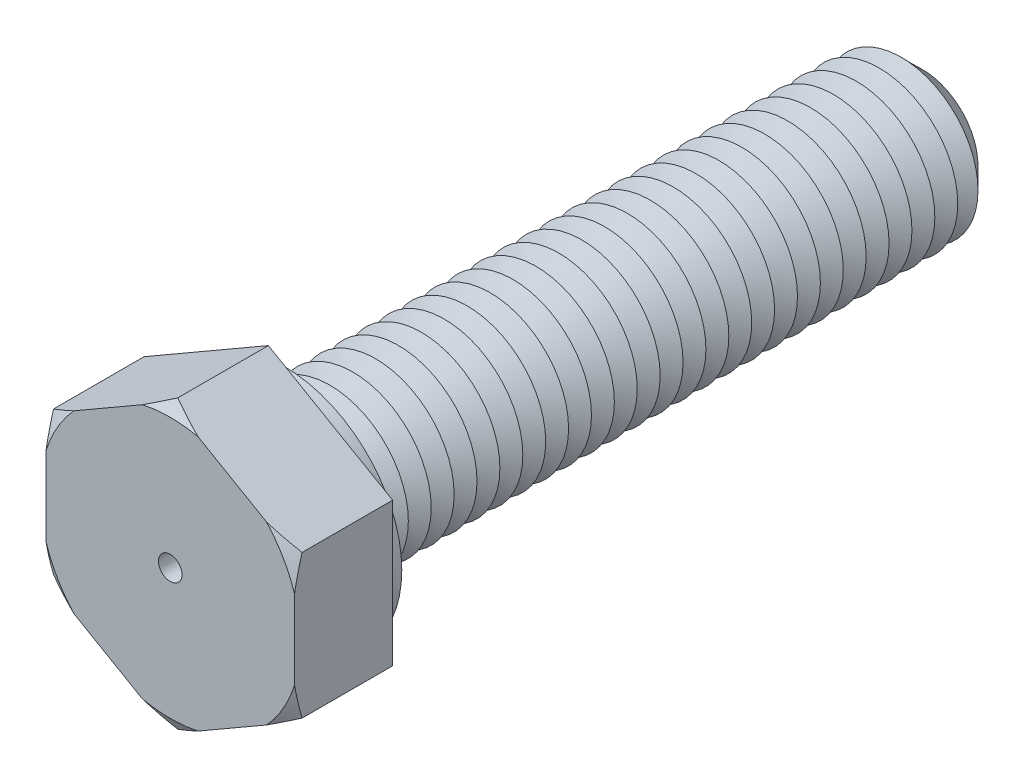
ISO-10303-21;
HEADER;
FILE_DESCRIPTION(('STEP AP214'),'2;1');
FILE_NAME('part.step','',(''),(''),'','','');
FILE_SCHEMA(('AUTOMOTIVE_DESIGN { 1 0 10303 214 1 1 1 1 }'));
ENDSEC;
DATA;
#1=APPLICATION_CONTEXT('core data for automotive mechanical design processes');
#2=APPLICATION_PROTOCOL_DEFINITION('international standard','automotive_design',2000,#1);
#3=PRODUCT_CONTEXT('',#1,'mechanical');
#4=PRODUCT('Part','Part','',(#3));
#5=PRODUCT_RELATED_PRODUCT_CATEGORY('part','',(#4));
#6=PRODUCT_DEFINITION_FORMATION('','',#4);
#7=PRODUCT_DEFINITION_CONTEXT('part definition',#1,'design');
#8=PRODUCT_DEFINITION('design','',#6,#7);
#9=PRODUCT_DEFINITION_SHAPE('','',#8);
#10=(LENGTH_UNIT() NAMED_UNIT(*) SI_UNIT(.MILLI.,.METRE.));
#11=(NAMED_UNIT(*) PLANE_ANGLE_UNIT() SI_UNIT($,.RADIAN.));
#12=(NAMED_UNIT(*) SI_UNIT($,.STERADIAN.) SOLID_ANGLE_UNIT());
#13=UNCERTAINTY_MEASURE_WITH_UNIT(LENGTH_MEASURE(1.E-05),#10,'distance_accuracy_value','');
#14=(GEOMETRIC_REPRESENTATION_CONTEXT(3) GLOBAL_UNCERTAINTY_ASSIGNED_CONTEXT((#13)) GLOBAL_UNIT_ASSIGNED_CONTEXT((#10,
#11,#12)) REPRESENTATION_CONTEXT('',''));
#15=CARTESIAN_POINT('',(0.,0.,0.));
#16=DIRECTION('',(0.,0.,1.));
#17=DIRECTION('',(1.,0.,0.));
#18=AXIS2_PLACEMENT_3D('',#15,#16,#17);
#19=CARTESIAN_POINT('',(9.5,5.48482755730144,7.5));
#20=DIRECTION('',(-0.5,-0.866025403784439,0.));
#21=DIRECTION('',(0.866025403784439,-0.5,0.));
#22=AXIS2_PLACEMENT_3D('',#19,#20,#21);
#23=PLANE('',#22);
#24=CARTESIAN_POINT('',(16.0911028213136,1.67945256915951,3.91531658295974));
#25=CARTESIAN_POINT('',(15.7926530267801,1.85176263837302,4.07633378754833));
#26=CARTESIAN_POINT('',(15.4934885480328,2.02448533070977,4.23561185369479));
#27=CARTESIAN_POINT('',(14.8934288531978,2.37092995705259,4.54987291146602));
#28=CARTESIAN_POINT('',(14.5925334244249,2.54465201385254,4.70485536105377));
#29=CARTESIAN_POINT('',(13.9878148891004,2.89378642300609,5.01015744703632));
#30=CARTESIAN_POINT('',(13.6839854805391,3.06920241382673,5.16046049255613));
#31=CARTESIAN_POINT('',(13.0740489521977,3.4213494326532,5.45475890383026));
#32=CARTESIAN_POINT('',(12.7679419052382,3.59808041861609,5.59875447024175));
#33=CARTESIAN_POINT('',(12.1452865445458,3.95757065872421,5.88261207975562));
#34=CARTESIAN_POINT('',(11.8286703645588,4.14036909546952,6.02227655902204));
#35=CARTESIAN_POINT('',(11.1922429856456,4.50781061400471,6.29164435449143));
#36=CARTESIAN_POINT('',(10.8724316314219,4.69245378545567,6.42134718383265));
#37=CARTESIAN_POINT('',(10.2295404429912,5.06362718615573,6.66831982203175));
#38=CARTESIAN_POINT('',(9.90646410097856,5.25015539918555,6.78560163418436));
#39=CARTESIAN_POINT('',(9.2565183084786,5.62540177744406,7.00502233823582));
#40=CARTESIAN_POINT('',(8.92964935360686,5.81411965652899,7.1071631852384));
#41=CARTESIAN_POINT('',(8.14786487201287,6.26548313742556,7.32807954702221));
#42=CARTESIAN_POINT('',(7.6911273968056,6.52918064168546,7.43861218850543));
#43=CARTESIAN_POINT('',(7.00135730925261,6.92741958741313,7.57140056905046));
#44=CARTESIAN_POINT('',(6.77066782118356,7.06060822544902,7.61016053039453));
#45=CARTESIAN_POINT('',(6.30799755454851,7.3277310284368,7.6757081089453));
#46=CARTESIAN_POINT('',(6.07601678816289,7.46166518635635,7.70249583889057));
#47=CARTESIAN_POINT('',(5.61390562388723,7.72846519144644,7.74308971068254));
#48=CARTESIAN_POINT('',(5.38378495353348,7.86132542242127,7.75704275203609));
#49=CARTESIAN_POINT('',(4.92322735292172,8.1272284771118,7.77208284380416));
#50=CARTESIAN_POINT('',(4.69279042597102,8.26027129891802,7.7731700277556));
#51=CARTESIAN_POINT('',(4.23214422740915,8.52622550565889,7.76244373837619));
#52=CARTESIAN_POINT('',(4.00193495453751,8.65913689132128,7.7506303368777));
#53=CARTESIAN_POINT('',(3.54223236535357,8.92454630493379,7.71446028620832));
#54=CARTESIAN_POINT('',(3.31273916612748,9.05704426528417,7.69010168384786));
#55=CARTESIAN_POINT('',(2.77042202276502,9.37015121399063,7.61833387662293));
#56=CARTESIAN_POINT('',(2.45810922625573,9.55046509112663,7.56573497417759));
#57=CARTESIAN_POINT('',(1.83647686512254,9.90936470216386,7.44074774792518));
#58=CARTESIAN_POINT('',(1.52715774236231,10.087950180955,7.36835654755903));
#59=CARTESIAN_POINT('',(0.911549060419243,10.4433720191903,7.20651778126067));
#60=CARTESIAN_POINT('',(0.605263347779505,10.6202061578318,7.1170509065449));
#61=CARTESIAN_POINT('',(-0.00386858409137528,10.9718886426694,6.92387899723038));
#62=CARTESIAN_POINT('',(-0.30671501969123,11.1467371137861,6.8201748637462));
#63=CARTESIAN_POINT('',(-0.912759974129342,11.496637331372,6.59968787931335));
#64=CARTESIAN_POINT('',(-1.21591973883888,11.6716667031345,6.48276398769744));
#65=CARTESIAN_POINT('',(-1.8190277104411,12.0198712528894,6.23911056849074));
#66=CARTESIAN_POINT('',(-2.11897790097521,12.1930475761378,6.11238754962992));
#67=CARTESIAN_POINT('',(-2.71614501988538,12.5378221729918,5.85087494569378));
#68=CARTESIAN_POINT('',(-3.01336251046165,12.7094207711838,5.71608706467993));
#69=CARTESIAN_POINT('',(-3.60546807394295,13.0512730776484,5.43985672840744));
#70=CARTESIAN_POINT('',(-3.90035610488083,13.2215267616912,5.29841415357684));
#71=CARTESIAN_POINT('',(-4.39671248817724,13.5080982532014,5.05486951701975));
#72=CARTESIAN_POINT('',(-4.59871463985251,13.624724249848,4.95421186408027));
#73=CARTESIAN_POINT('',(-5.00183994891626,13.8574687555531,4.75059724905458));
#74=CARTESIAN_POINT('',(-5.20296313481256,13.9735872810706,4.647640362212));
#75=CARTESIAN_POINT('',(-5.60231741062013,14.2041545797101,4.44078592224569));
#76=CARTESIAN_POINT('',(-5.80055672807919,14.3186081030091,4.33690951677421));
#77=CARTESIAN_POINT('',(-6.19633679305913,14.5471118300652,4.12738601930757));
#78=CARTESIAN_POINT('',(-6.39387752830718,14.6611620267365,4.02173889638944));
#79=CARTESIAN_POINT('',(-6.59110282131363,14.7750301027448,3.91531658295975));
#80=B_SPLINE_CURVE_WITH_KNOTS('',3,(#24,#25,#26,#27,#28,#29,#30,#31,#32,#33,#34,#35,#36,#37,#38,
#39,#40,#41,#42,#43,#44,#45,#46,#47,#48,#49,#50,#51,#52,#53,#54,#55,#56,#57,#58,#59,#60,#61,#62,
#63,#64,#65,#66,#67,#68,#69,#70,#71,#72,#73,#74,#75,#76,#77,#78,#79),.UNSPECIFIED.,.F.,.F.,(4,2,
2,2,2,2,2,2,2,2,2,2,2,2,2,2,2,2,2,2,2,2,2,2,2,2,2,4),(0.,1.14115474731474,2.28245284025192,
3.42741980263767,4.57235031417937,5.74632926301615,6.92036555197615,8.09325673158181,
9.26599632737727,10.8807998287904,11.6881240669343,12.4954407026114,13.2933978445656,
14.0913467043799,14.8892911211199,15.6873598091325,16.7800286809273,17.8728564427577,
18.9669273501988,20.0609290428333,21.1679585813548,22.2742590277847,23.380326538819,
24.4864139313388,25.2485345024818,26.010630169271,26.7647435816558,27.5188701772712),.UNSPECIFIED.);
#81=CARTESIAN_POINT('',(9.5,5.48482755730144,6.92264973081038));
#82=VERTEX_POINT('',#81);
#83=CARTESIAN_POINT('',(7.36878164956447,6.71528704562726,7.5));
#84=VERTEX_POINT('',#83);
#85=EDGE_CURVE('E132',#82,#84,#80,.T.);
#86=ORIENTED_EDGE('',*,*,#85,.F.);
#87=DIRECTION('',(0.,0.,-1.));
#88=VECTOR('',#87,1.);
#89=CARTESIAN_POINT('',(9.5,5.48482755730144,7.5));
#90=LINE('',#89,#88);
#91=CARTESIAN_POINT('',(9.5,5.48482755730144,0.));
#92=VERTEX_POINT('',#91);
#93=EDGE_CURVE('E144',#82,#92,#90,.T.);
#94=ORIENTED_EDGE('',*,*,#93,.T.);
#95=DIRECTION('',(-0.866025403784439,0.5,0.));
#96=VECTOR('',#95,1.);
#97=CARTESIAN_POINT('',(9.5,5.48482755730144,0.));
#98=LINE('',#97,#96);
#99=CARTESIAN_POINT('',(0.,10.9696551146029,0.));
#100=VERTEX_POINT('',#99);
#101=EDGE_CURVE('E418',#92,#100,#98,.T.);
#102=ORIENTED_EDGE('',*,*,#101,.T.);
#103=DIRECTION('',(0.,0.,-1.));
#104=VECTOR('',#103,1.);
#105=CARTESIAN_POINT('',(0.,10.9696551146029,7.5));
#106=LINE('',#105,#104);
#107=CARTESIAN_POINT('',(0.,10.9696551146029,6.92264973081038));
#108=VERTEX_POINT('',#107);
#109=EDGE_CURVE('E179',#108,#100,#106,.T.);
#110=ORIENTED_EDGE('',*,*,#109,.F.);
#111=CARTESIAN_POINT('',(2.13121835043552,9.73919562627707,7.5));
#112=VERTEX_POINT('',#111);
#113=EDGE_CURVE('E151',#112,#108,#80,.T.);
#114=ORIENTED_EDGE('',*,*,#113,.F.);
#115=DIRECTION('',(-0.866025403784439,0.5,0.));
#116=VECTOR('',#115,1.);
#117=CARTESIAN_POINT('',(9.5,5.48482755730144,7.5));
#118=LINE('',#117,#116);
#119=EDGE_CURVE('E148',#84,#112,#118,.T.);
#120=ORIENTED_EDGE('',*,*,#119,.F.);
#121=EDGE_LOOP('',(#86,#94,#102,#110,#114,#120));
#122=FACE_BOUND('',#121,.T.);
#123=ADVANCED_FACE('F39',(#122),#23,.F.);
#124=CARTESIAN_POINT('',(0.,10.9696551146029,7.5));
#125=DIRECTION('',(0.5,-0.866025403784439,0.));
#126=DIRECTION('',(0.866025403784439,0.5,0.));
#127=AXIS2_PLACEMENT_3D('',#124,#125,#126);
#128=PLANE('',#127);
#129=CARTESIAN_POINT('',(6.59110282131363,14.7750301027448,3.91531658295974));
#130=CARTESIAN_POINT('',(6.29265302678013,14.6027200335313,4.07633378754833));
#131=CARTESIAN_POINT('',(5.99348854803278,14.4299973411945,4.23561185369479));
#132=CARTESIAN_POINT('',(5.3934288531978,14.0835527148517,4.54987291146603));
#133=CARTESIAN_POINT('',(5.09253342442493,13.9098306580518,4.70485536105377));
#134=CARTESIAN_POINT('',(4.48781488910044,13.5606962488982,5.01015744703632));
#135=CARTESIAN_POINT('',(4.18398548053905,13.3852802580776,5.16046049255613));
#136=CARTESIAN_POINT('',(3.5740489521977,13.0331332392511,5.45475890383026));
#137=CARTESIAN_POINT('',(3.26794190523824,12.8564022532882,5.59875447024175));
#138=CARTESIAN_POINT('',(2.64528654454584,12.4969120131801,5.88261207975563));
#139=CARTESIAN_POINT('',(2.32867036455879,12.3141135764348,6.02227655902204));
#140=CARTESIAN_POINT('',(1.69224298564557,11.9466720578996,6.29164435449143));
#141=CARTESIAN_POINT('',(1.37243163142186,11.7620288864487,6.42134718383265));
#142=CARTESIAN_POINT('',(0.729540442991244,11.3908554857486,6.66831982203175));
#143=CARTESIAN_POINT('',(0.406464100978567,11.2043272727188,6.78560163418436));
#144=CARTESIAN_POINT('',(-0.243481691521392,10.8290808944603,7.00502233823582));
#145=CARTESIAN_POINT('',(-0.570350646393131,10.6403630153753,7.1071631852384));
#146=CARTESIAN_POINT('',(-1.35213512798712,10.1889995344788,7.32807954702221));
#147=CARTESIAN_POINT('',(-1.80887260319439,9.92530203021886,7.43861218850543));
#148=CARTESIAN_POINT('',(-2.49864269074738,9.52706308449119,7.57140056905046));
#149=CARTESIAN_POINT('',(-2.72933217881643,9.39387444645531,7.61016053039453));
#150=CARTESIAN_POINT('',(-3.19200244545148,9.12675164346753,7.6757081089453));
#151=CARTESIAN_POINT('',(-3.4239832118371,8.99281748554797,7.70249583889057));
#152=CARTESIAN_POINT('',(-3.88609437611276,8.72601748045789,7.74308971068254));
#153=CARTESIAN_POINT('',(-4.11621504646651,8.59315724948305,7.75704275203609));
#154=CARTESIAN_POINT('',(-4.57677264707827,8.32725419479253,7.77208284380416));
#155=CARTESIAN_POINT('',(-4.80720957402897,8.19421137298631,7.7731700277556));
#156=CARTESIAN_POINT('',(-5.26785577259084,7.92825716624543,7.76244373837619));
#157=CARTESIAN_POINT('',(-5.49806504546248,7.79534578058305,7.7506303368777));
#158=CARTESIAN_POINT('',(-5.95776763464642,7.52993636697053,7.71446028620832));
#159=CARTESIAN_POINT('',(-6.18726083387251,7.39743840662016,7.69010168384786));
#160=CARTESIAN_POINT('',(-6.72957797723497,7.0843314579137,7.61833387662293));
#161=CARTESIAN_POINT('',(-7.04189077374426,6.90401758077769,7.56573497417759));
#162=CARTESIAN_POINT('',(-7.66352313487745,6.54511796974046,7.44074774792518));
#163=CARTESIAN_POINT('',(-7.97284225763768,6.36653249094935,7.36835654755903));
#164=CARTESIAN_POINT('',(-8.58845093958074,6.01111065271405,7.20651778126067));
#165=CARTESIAN_POINT('',(-8.89473665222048,5.83427651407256,7.1170509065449));
#166=CARTESIAN_POINT('',(-9.50386858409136,5.48259402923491,6.92387899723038));
#167=CARTESIAN_POINT('',(-9.80671501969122,5.30774555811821,6.8201748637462));
#168=CARTESIAN_POINT('',(-10.4127599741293,4.95784534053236,6.59968787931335));
#169=CARTESIAN_POINT('',(-10.7159197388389,4.78281596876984,6.48276398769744));
#170=CARTESIAN_POINT('',(-11.3190277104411,4.43461141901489,6.23911056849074));
#171=CARTESIAN_POINT('',(-11.6189779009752,4.26143509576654,6.11238754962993));
#172=CARTESIAN_POINT('',(-12.2161450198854,3.91666049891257,5.85087494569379));
#173=CARTESIAN_POINT('',(-12.5133625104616,3.74506190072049,5.71608706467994));
#174=CARTESIAN_POINT('',(-13.1054680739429,3.40320959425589,5.43985672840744));
#175=CARTESIAN_POINT('',(-13.4003561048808,3.2329559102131,5.29841415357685));
#176=CARTESIAN_POINT('',(-13.8967124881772,2.94638441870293,5.05486951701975));
#177=CARTESIAN_POINT('',(-14.0987146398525,2.82975842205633,4.95421186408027));
#178=CARTESIAN_POINT('',(-14.5018399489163,2.59701391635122,4.75059724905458));
#179=CARTESIAN_POINT('',(-14.7029631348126,2.48089539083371,4.647640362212));
#180=CARTESIAN_POINT('',(-15.1023174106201,2.25032809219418,4.44078592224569));
#181=CARTESIAN_POINT('',(-15.3005567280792,2.13587456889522,4.33690951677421));
#182=CARTESIAN_POINT('',(-15.6963367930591,1.90737084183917,4.12738601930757));
#183=CARTESIAN_POINT('',(-15.8938775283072,1.79332064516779,4.02173889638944));
#184=CARTESIAN_POINT('',(-16.0911028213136,1.67945256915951,3.91531658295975));
#185=B_SPLINE_CURVE_WITH_KNOTS('',3,(#129,#130,#131,#132,#133,#134,#135,#136,#137,#138,#139,
#140,#141,#142,#143,#144,#145,#146,#147,#148,#149,#150,#151,#152,#153,#154,#155,#156,#157,#158,
#159,#160,#161,#162,#163,#164,#165,#166,#167,#168,#169,#170,#171,#172,#173,#174,#175,#176,#177,
#178,#179,#180,#181,#182,#183,#184),.UNSPECIFIED.,.F.,.F.,(4,2,2,2,2,2,2,2,2,2,2,2,2,2,2,2,2,2,
2,2,2,2,2,2,2,2,2,4),(0.,1.14115474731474,2.28245284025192,3.42741980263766,4.57235031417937,
5.74632926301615,6.92036555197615,8.09325673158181,9.26599632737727,10.8807998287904,
11.6881240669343,12.4954407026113,13.2933978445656,14.0913467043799,14.8892911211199,
15.6873598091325,16.7800286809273,17.8728564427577,18.9669273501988,20.0609290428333,
21.1679585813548,22.2742590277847,23.380326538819,24.4864139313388,25.2485345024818,
26.010630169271,26.7647435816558,27.5188701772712),.UNSPECIFIED.);
#186=CARTESIAN_POINT('',(-2.13121835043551,9.73919562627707,7.5));
#187=VERTEX_POINT('',#186);
#188=EDGE_CURVE('E1309',#108,#187,#185,.T.);
#189=ORIENTED_EDGE('',*,*,#188,.F.);
#190=ORIENTED_EDGE('',*,*,#109,.T.);
#191=DIRECTION('',(-0.866025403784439,-0.5,0.));
#192=VECTOR('',#191,1.);
#193=CARTESIAN_POINT('',(0.,10.9696551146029,0.));
#194=LINE('',#193,#192);
#195=CARTESIAN_POINT('',(-9.5,5.48482755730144,0.));
#196=VERTEX_POINT('',#195);
#197=EDGE_CURVE('E438',#100,#196,#194,.T.);
#198=ORIENTED_EDGE('',*,*,#197,.T.);
#199=DIRECTION('',(0.,0.,-1.));
#200=VECTOR('',#199,1.);
#201=CARTESIAN_POINT('',(-9.5,5.48482755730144,7.5));
#202=LINE('',#201,#200);
#203=CARTESIAN_POINT('',(-9.5,5.48482755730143,6.92264973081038));
#204=VERTEX_POINT('',#203);
#205=EDGE_CURVE('E176',#204,#196,#202,.T.);
#206=ORIENTED_EDGE('',*,*,#205,.F.);
#207=CARTESIAN_POINT('',(-7.36878164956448,6.71528704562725,7.5));
#208=VERTEX_POINT('',#207);
#209=EDGE_CURVE('E513',#208,#204,#185,.T.);
#210=ORIENTED_EDGE('',*,*,#209,.F.);
#211=DIRECTION('',(-0.866025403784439,-0.5,0.));
#212=VECTOR('',#211,1.);
#213=CARTESIAN_POINT('',(0.,10.9696551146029,7.5));
#214=LINE('',#213,#212);
#215=EDGE_CURVE('E421',#187,#208,#214,.T.);
#216=ORIENTED_EDGE('',*,*,#215,.F.);
#217=EDGE_LOOP('',(#189,#190,#198,#206,#210,#216));
#218=FACE_BOUND('',#217,.T.);
#219=ADVANCED_FACE('F522',(#218),#128,.F.);
#220=CARTESIAN_POINT('',(-9.5,5.48482755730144,7.5));
#221=DIRECTION('',(1.,0.,0.));
#222=DIRECTION('',(0.,1.,0.));
#223=AXIS2_PLACEMENT_3D('',#220,#221,#222);
#224=PLANE('',#223);
#225=CARTESIAN_POINT('',(-9.5,12.0759303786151,4.38509256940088));
#226=CARTESIAN_POINT('',(-9.5,11.7327439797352,4.5407773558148));
#227=CARTESIAN_POINT('',(-9.5,11.388618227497,4.69443095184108));
#228=CARTESIAN_POINT('',(-9.5,10.698085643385,4.99669009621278));
#229=CARTESIAN_POINT('',(-9.5,10.3516784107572,5.1452947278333));
#230=CARTESIAN_POINT('',(-9.5,9.65484997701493,5.43702212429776));
#231=CARTESIAN_POINT('',(-9.5,9.30441804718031,5.58011936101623));
#232=CARTESIAN_POINT('',(-9.5,8.60059023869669,5.85880989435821));
#233=CARTESIAN_POINT('',(-9.5,8.24719449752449,5.9944035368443));
#234=CARTESIAN_POINT('',(-9.5,7.53860340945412,6.25582574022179));
#235=CARTESIAN_POINT('',(-9.5,7.18342337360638,6.38169559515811));
#236=CARTESIAN_POINT('',(-9.5,6.46926569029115,6.62229858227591));
#237=CARTESIAN_POINT('',(-9.5,6.11028785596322,6.73703116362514));
#238=CARTESIAN_POINT('',(-9.5,5.38872372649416,6.95272419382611));
#239=CARTESIAN_POINT('',(-9.5,5.02614305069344,7.05370330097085));
#240=CARTESIAN_POINT('',(-9.5,4.29675196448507,7.23920160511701));
#241=CARTESIAN_POINT('',(-9.5,3.92994173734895,7.32372151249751));
#242=CARTESIAN_POINT('',(-9.5,3.29665308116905,7.45205940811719));
#243=CARTESIAN_POINT('',(-9.5,3.03113701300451,7.50062833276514));
#244=CARTESIAN_POINT('',(-9.5,2.49832809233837,7.5865841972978));
#245=CARTESIAN_POINT('',(-9.5,2.23103554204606,7.62397299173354));
#246=CARTESIAN_POINT('',(-9.5,1.69506861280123,7.68659004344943));
#247=CARTESIAN_POINT('',(-9.5,1.42639449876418,7.71182055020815));
#248=CARTESIAN_POINT('',(-9.5,0.888138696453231,7.74939803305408));
#249=CARTESIAN_POINT('',(-9.5,0.618557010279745,7.76174503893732));
#250=CARTESIAN_POINT('',(-9.5,0.0792458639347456,7.77317034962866));
#251=CARTESIAN_POINT('',(-9.5,-0.190483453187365,7.77225534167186));
#252=CARTESIAN_POINT('',(-9.5,-0.729567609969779,7.75720205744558));
#253=CARTESIAN_POINT('',(-9.5,-0.998922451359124,7.74306384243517));
#254=CARTESIAN_POINT('',(-9.5,-1.53667618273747,7.70199575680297));
#255=CARTESIAN_POINT('',(-9.5,-1.80507496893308,7.67506453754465));
#256=CARTESIAN_POINT('',(-9.5,-2.34038611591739,7.60918517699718));
#257=CARTESIAN_POINT('',(-9.5,-2.60729841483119,7.57023653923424));
#258=CARTESIAN_POINT('',(-9.5,-3.27166409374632,7.45918941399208));
#259=CARTESIAN_POINT('',(-9.5,-3.66797754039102,7.38023980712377));
#260=CARTESIAN_POINT('',(-9.5,-4.45585575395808,7.20141943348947));
#261=CARTESIAN_POINT('',(-9.5,-4.8474194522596,7.10154404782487));
#262=CARTESIAN_POINT('',(-9.5,-5.6265713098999,6.88438943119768));
#263=CARTESIAN_POINT('',(-9.5,-6.01414884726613,6.76707245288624));
#264=CARTESIAN_POINT('',(-9.5,-6.78474185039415,6.51851091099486));
#265=CARTESIAN_POINT('',(-9.5,-7.16775763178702,6.38726731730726));
#266=CARTESIAN_POINT('',(-9.5,-7.93407213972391,6.11202298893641));
#267=CARTESIAN_POINT('',(-9.5,-8.31732458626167,5.96789419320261));
#268=CARTESIAN_POINT('',(-9.5,-9.08024927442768,5.67043108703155));
#269=CARTESIAN_POINT('',(-9.5,-9.4599212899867,5.51709619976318));
#270=CARTESIAN_POINT('',(-9.5,-10.2138362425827,5.20397874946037));
#271=CARTESIAN_POINT('',(-9.5,-10.5880982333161,5.04424191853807));
#272=CARTESIAN_POINT('',(-9.5,-11.1474871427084,4.80018423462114));
#273=CARTESIAN_POINT('',(-9.5,-11.3335947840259,4.71809930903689));
#274=CARTESIAN_POINT('',(-9.5,-11.7052038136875,4.55257683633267));
#275=CARTESIAN_POINT('',(-9.5,-11.8907052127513,4.46913931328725));
#276=CARTESIAN_POINT('',(-9.5,-12.0759303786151,4.38509256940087));
#277=B_SPLINE_CURVE_WITH_KNOTS('',3,(#225,#226,#227,#228,#229,#230,#231,#232,#233,#234,#235,
#236,#237,#238,#239,#240,#241,#242,#243,#244,#245,#246,#247,#248,#249,#250,#251,#252,#253,#254,
#255,#256,#257,#258,#259,#260,#261,#262,#263,#264,#265,#266,#267,#268,#269,#270,#271,#272,#273,
#274,#275,#276),.UNSPECIFIED.,.F.,.F.,(4,2,2,2,2,2,2,2,2,2,2,2,2,2,2,2,2,2,2,2,2,2,2,2,2,4),(0.,
1.13056270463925,2.26132959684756,3.39682602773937,4.53227007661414,5.66259174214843,
6.79296928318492,7.92179771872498,9.0505774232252,9.86013572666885,10.6695596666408,
11.4788337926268,12.288106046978,13.0969702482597,13.9058307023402,14.7147764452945,
15.5237556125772,16.7353316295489,17.9471753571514,19.1616810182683,20.3761021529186,
21.6043286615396,22.8326322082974,24.0533405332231,24.6635541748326,25.273756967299),.UNSPECIFIED.);
#278=CARTESIAN_POINT('',(-9.5,3.02390858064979,7.5));
#279=VERTEX_POINT('',#278);
#280=EDGE_CURVE('E512',#204,#279,#277,.T.);
#281=ORIENTED_EDGE('',*,*,#280,.F.);
#282=ORIENTED_EDGE('',*,*,#205,.T.);
#283=DIRECTION('',(0.,-1.,0.));
#284=VECTOR('',#283,1.);
#285=CARTESIAN_POINT('',(-9.5,5.48482755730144,0.));
#286=LINE('',#285,#284);
#287=CARTESIAN_POINT('',(-9.5,-5.48482755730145,0.));
#288=VERTEX_POINT('',#287);
#289=EDGE_CURVE('E441',#196,#288,#286,.T.);
#290=ORIENTED_EDGE('',*,*,#289,.T.);
#291=DIRECTION('',(0.,0.,-1.));
#292=VECTOR('',#291,1.);
#293=CARTESIAN_POINT('',(-9.5,-5.48482755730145,7.5));
#294=LINE('',#293,#292);
#295=CARTESIAN_POINT('',(-9.49999999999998,-5.48482755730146,6.92264973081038));
#296=VERTEX_POINT('',#295);
#297=EDGE_CURVE('E173',#296,#288,#294,.T.);
#298=ORIENTED_EDGE('',*,*,#297,.F.);
#299=CARTESIAN_POINT('',(-9.5,-3.02390858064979,7.5));
#300=VERTEX_POINT('',#299);
#301=EDGE_CURVE('E462',#300,#296,#277,.T.);
#302=ORIENTED_EDGE('',*,*,#301,.F.);
#303=DIRECTION('',(0.,-1.,0.));
#304=VECTOR('',#303,1.);
#305=CARTESIAN_POINT('',(-9.5,5.48482755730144,7.5));
#306=LINE('',#305,#304);
#307=EDGE_CURVE('E425',#279,#300,#306,.T.);
#308=ORIENTED_EDGE('',*,*,#307,.F.);
#309=EDGE_LOOP('',(#281,#282,#290,#298,#302,#308));
#310=FACE_BOUND('',#309,.T.);
#311=ADVANCED_FACE('F518',(#310),#224,.F.);
#312=CARTESIAN_POINT('',(-9.5,-5.48482755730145,7.5));
#313=DIRECTION('',(0.5,0.866025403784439,0.));
#314=DIRECTION('',(-0.866025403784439,0.5,0.));
#315=AXIS2_PLACEMENT_3D('',#312,#313,#314);
#316=PLANE('',#315);
#317=CARTESIAN_POINT('',(-16.0911028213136,-1.67945256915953,3.91531658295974));
#318=CARTESIAN_POINT('',(-15.7926530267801,-1.85176263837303,4.07633378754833));
#319=CARTESIAN_POINT('',(-15.4934885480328,-2.02448533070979,4.23561185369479));
#320=CARTESIAN_POINT('',(-14.8934288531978,-2.37092995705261,4.54987291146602));
#321=CARTESIAN_POINT('',(-14.5925334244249,-2.54465201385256,4.70485536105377));
#322=CARTESIAN_POINT('',(-13.9878148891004,-2.89378642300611,5.01015744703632));
#323=CARTESIAN_POINT('',(-13.683985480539,-3.06920241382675,5.16046049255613));
#324=CARTESIAN_POINT('',(-13.0740489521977,-3.42134943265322,5.45475890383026));
#325=CARTESIAN_POINT('',(-12.7679419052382,-3.5980804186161,5.59875447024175));
#326=CARTESIAN_POINT('',(-12.1452865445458,-3.95757065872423,5.88261207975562));
#327=CARTESIAN_POINT('',(-11.8286703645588,-4.14036909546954,6.02227655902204));
#328=CARTESIAN_POINT('',(-11.1922429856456,-4.50781061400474,6.29164435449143));
#329=CARTESIAN_POINT('',(-10.8724316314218,-4.69245378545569,6.42134718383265));
#330=CARTESIAN_POINT('',(-10.2295404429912,-5.06362718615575,6.66831982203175));
#331=CARTESIAN_POINT('',(-9.90646410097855,-5.25015539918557,6.78560163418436));
#332=CARTESIAN_POINT('',(-9.25651830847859,-5.62540177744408,7.00502233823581));
#333=CARTESIAN_POINT('',(-8.92964935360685,-5.81411965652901,7.1071631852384));
#334=CARTESIAN_POINT('',(-8.14786487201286,-6.26548313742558,7.32807954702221));
#335=CARTESIAN_POINT('',(-7.69112739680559,-6.52918064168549,7.43861218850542));
#336=CARTESIAN_POINT('',(-7.0013573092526,-6.92741958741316,7.57140056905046));
#337=CARTESIAN_POINT('',(-6.77066782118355,-7.06060822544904,7.61016053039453));
#338=CARTESIAN_POINT('',(-6.3079975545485,-7.32773102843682,7.6757081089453));
#339=CARTESIAN_POINT('',(-6.07601678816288,-7.46166518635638,7.70249583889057));
#340=CARTESIAN_POINT('',(-5.61390562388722,-7.72846519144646,7.74308971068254));
#341=CARTESIAN_POINT('',(-5.38378495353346,-7.8613254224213,7.75704275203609));
#342=CARTESIAN_POINT('',(-4.9232273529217,-8.12722847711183,7.77208284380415));
#343=CARTESIAN_POINT('',(-4.692790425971,-8.26027129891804,7.77317002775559));
#344=CARTESIAN_POINT('',(-4.23214422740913,-8.52622550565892,7.76244373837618));
#345=CARTESIAN_POINT('',(-4.00193495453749,-8.6591368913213,7.75063033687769));
#346=CARTESIAN_POINT('',(-3.54223236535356,-8.92454630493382,7.71446028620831));
#347=CARTESIAN_POINT('',(-3.31273916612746,-9.05704426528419,7.69010168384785));
#348=CARTESIAN_POINT('',(-2.770422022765,-9.37015121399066,7.61833387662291));
#349=CARTESIAN_POINT('',(-2.45810922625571,-9.55046509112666,7.56573497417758));
#350=CARTESIAN_POINT('',(-1.83647686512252,-9.9093647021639,7.44074774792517));
#351=CARTESIAN_POINT('',(-1.52715774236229,-10.087950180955,7.36835654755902));
#352=CARTESIAN_POINT('',(-0.911549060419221,-10.4433720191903,7.20651778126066));
#353=CARTESIAN_POINT('',(-0.605263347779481,-10.6202061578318,7.11705090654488));
#354=CARTESIAN_POINT('',(0.00386858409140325,-10.9718886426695,6.92387899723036));
#355=CARTESIAN_POINT('',(0.30671501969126,-11.1467371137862,6.82017486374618));
#356=CARTESIAN_POINT('',(0.912759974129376,-11.496637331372,6.59968787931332));
#357=CARTESIAN_POINT('',(1.21591973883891,-11.6716667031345,6.48276398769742));
#358=CARTESIAN_POINT('',(1.81902771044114,-12.0198712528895,6.23911056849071));
#359=CARTESIAN_POINT('',(2.11897790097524,-12.1930475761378,6.11238754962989));
#360=CARTESIAN_POINT('',(2.71614501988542,-12.5378221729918,5.85087494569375));
#361=CARTESIAN_POINT('',(3.01336251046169,-12.7094207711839,5.7160870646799));
#362=CARTESIAN_POINT('',(3.60546807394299,-13.0512730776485,5.4398567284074));
#363=CARTESIAN_POINT('',(3.90035610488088,-13.2215267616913,5.29841415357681));
#364=CARTESIAN_POINT('',(4.39671248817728,-13.5080982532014,5.05486951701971));
#365=CARTESIAN_POINT('',(4.59871463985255,-13.624724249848,4.95421186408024));
#366=CARTESIAN_POINT('',(5.00183994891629,-13.8574687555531,4.75059724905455));
#367=CARTESIAN_POINT('',(5.20296313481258,-13.9735872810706,4.64764036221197));
#368=CARTESIAN_POINT('',(5.60231741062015,-14.2041545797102,4.44078592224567));
#369=CARTESIAN_POINT('',(5.8005567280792,-14.3186081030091,4.33690951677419));
#370=CARTESIAN_POINT('',(6.19633679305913,-14.5471118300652,4.12738601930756));
#371=CARTESIAN_POINT('',(6.39387752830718,-14.6611620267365,4.02173889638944));
#372=CARTESIAN_POINT('',(6.59110282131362,-14.7750301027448,3.91531658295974));
#373=B_SPLINE_CURVE_WITH_KNOTS('',3,(#317,#318,#319,#320,#321,#322,#323,#324,#325,#326,#327,
#328,#329,#330,#331,#332,#333,#334,#335,#336,#337,#338,#339,#340,#341,#342,#343,#344,#345,#346,
#347,#348,#349,#350,#351,#352,#353,#354,#355,#356,#357,#358,#359,#360,#361,#362,#363,#364,#365,
#366,#367,#368,#369,#370,#371,#372),.UNSPECIFIED.,.F.,.F.,(4,2,2,2,2,2,2,2,2,2,2,2,2,2,2,2,2,2,
2,2,2,2,2,2,2,2,2,4),(0.,1.14115474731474,2.28245284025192,3.42741980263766,4.57235031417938,
5.74632926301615,6.92036555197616,8.09325673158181,9.26599632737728,10.8807998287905,
11.6881240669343,12.4954407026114,13.2933978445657,14.0913467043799,14.8892911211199,
15.6873598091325,16.7800286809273,17.8728564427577,18.9669273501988,20.0609290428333,
21.1679585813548,22.2742590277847,23.3803265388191,24.4864139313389,25.2485345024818,
26.010630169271,26.7647435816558,27.5188701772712),.UNSPECIFIED.);
#374=CARTESIAN_POINT('',(-7.36878164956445,-6.71528704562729,7.5));
#375=VERTEX_POINT('',#374);
#376=EDGE_CURVE('E460',#296,#375,#373,.T.);
#377=ORIENTED_EDGE('',*,*,#376,.F.);
#378=ORIENTED_EDGE('',*,*,#297,.T.);
#379=DIRECTION('',(0.866025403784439,-0.5,0.));
#380=VECTOR('',#379,1.);
#381=CARTESIAN_POINT('',(-9.5,-5.48482755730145,0.));
#382=LINE('',#381,#380);
#383=CARTESIAN_POINT('',(0.,-10.9696551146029,0.));
#384=VERTEX_POINT('',#383);
#385=EDGE_CURVE('E444',#288,#384,#382,.T.);
#386=ORIENTED_EDGE('',*,*,#385,.T.);
#387=DIRECTION('',(0.,0.,-1.));
#388=VECTOR('',#387,1.);
#389=CARTESIAN_POINT('',(0.,-10.9696551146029,7.5));
#390=LINE('',#389,#388);
#391=CARTESIAN_POINT('',(0.,-10.9696551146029,6.92264973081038));
#392=VERTEX_POINT('',#391);
#393=EDGE_CURVE('E163',#392,#384,#390,.T.);
#394=ORIENTED_EDGE('',*,*,#393,.F.);
#395=CARTESIAN_POINT('',(-2.13121835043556,-9.73919562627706,7.5));
#396=VERTEX_POINT('',#395);
#397=EDGE_CURVE('E463',#396,#392,#373,.T.);
#398=ORIENTED_EDGE('',*,*,#397,.F.);
#399=DIRECTION('',(0.866025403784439,-0.5,0.));
#400=VECTOR('',#399,1.);
#401=CARTESIAN_POINT('',(-9.5,-5.48482755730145,7.5));
#402=LINE('',#401,#400);
#403=EDGE_CURVE('E429',#375,#396,#402,.T.);
#404=ORIENTED_EDGE('',*,*,#403,.F.);
#405=EDGE_LOOP('',(#377,#378,#386,#394,#398,#404));
#406=FACE_BOUND('',#405,.T.);
#407=ADVANCED_FACE('F521',(#406),#316,.F.);
#408=CARTESIAN_POINT('',(0.,-10.9696551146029,7.5));
#409=DIRECTION('',(-0.5,0.866025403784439,0.));
#410=DIRECTION('',(-0.866025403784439,-0.5,0.));
#411=AXIS2_PLACEMENT_3D('',#408,#409,#410);
#412=PLANE('',#411);
#413=CARTESIAN_POINT('',(-6.59110282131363,-14.7750301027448,3.91531658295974));
#414=CARTESIAN_POINT('',(-6.29265302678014,-14.6027200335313,4.07633378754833));
#415=CARTESIAN_POINT('',(-5.99348854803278,-14.4299973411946,4.23561185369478));
#416=CARTESIAN_POINT('',(-5.3934288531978,-14.0835527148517,4.54987291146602));
#417=CARTESIAN_POINT('',(-5.09253342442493,-13.9098306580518,4.70485536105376));
#418=CARTESIAN_POINT('',(-4.48781488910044,-13.5606962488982,5.01015744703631));
#419=CARTESIAN_POINT('',(-4.18398548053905,-13.3852802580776,5.16046049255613));
#420=CARTESIAN_POINT('',(-3.5740489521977,-13.0331332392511,5.45475890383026));
#421=CARTESIAN_POINT('',(-3.26794190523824,-12.8564022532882,5.59875447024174));
#422=CARTESIAN_POINT('',(-2.64528654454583,-12.4969120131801,5.88261207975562));
#423=CARTESIAN_POINT('',(-2.32867036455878,-12.3141135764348,6.02227655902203));
#424=CARTESIAN_POINT('',(-1.69224298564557,-11.9466720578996,6.29164435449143));
#425=CARTESIAN_POINT('',(-1.37243163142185,-11.7620288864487,6.42134718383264));
#426=CARTESIAN_POINT('',(-0.729540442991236,-11.3908554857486,6.66831982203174));
#427=CARTESIAN_POINT('',(-0.406464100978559,-11.2043272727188,6.78560163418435));
#428=CARTESIAN_POINT('',(0.243481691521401,-10.8290808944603,7.00502233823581));
#429=CARTESIAN_POINT('',(0.570350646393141,-10.6403630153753,7.10716318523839));
#430=CARTESIAN_POINT('',(1.35213512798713,-10.1889995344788,7.3280795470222));
#431=CARTESIAN_POINT('',(1.8088726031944,-9.92530203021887,7.43861218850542));
#432=CARTESIAN_POINT('',(2.49864269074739,-9.5270630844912,7.57140056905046));
#433=CARTESIAN_POINT('',(2.72933217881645,-9.39387444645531,7.61016053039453));
#434=CARTESIAN_POINT('',(3.19200244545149,-9.12675164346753,7.6757081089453));
#435=CARTESIAN_POINT('',(3.42398321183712,-8.99281748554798,7.70249583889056));
#436=CARTESIAN_POINT('',(3.88609437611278,-8.72601748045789,7.74308971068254));
#437=CARTESIAN_POINT('',(4.11621504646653,-8.59315724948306,7.75704275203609));
#438=CARTESIAN_POINT('',(4.57677264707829,-8.32725419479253,7.77208284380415));
#439=CARTESIAN_POINT('',(4.80720957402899,-8.19421137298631,7.77317002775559));
#440=CARTESIAN_POINT('',(5.26785577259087,-7.92825716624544,7.76244373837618));
#441=CARTESIAN_POINT('',(5.4980650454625,-7.79534578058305,7.75063033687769));
#442=CARTESIAN_POINT('',(5.95776763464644,-7.52993636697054,7.71446028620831));
#443=CARTESIAN_POINT('',(6.18726083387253,-7.39743840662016,7.69010168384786));
#444=CARTESIAN_POINT('',(6.72957797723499,-7.0843314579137,7.61833387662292));
#445=CARTESIAN_POINT('',(7.04189077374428,-6.9040175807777,7.56573497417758));
#446=CARTESIAN_POINT('',(7.66352313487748,-6.54511796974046,7.44074774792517));
#447=CARTESIAN_POINT('',(7.97284225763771,-6.36653249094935,7.36835654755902));
#448=CARTESIAN_POINT('',(8.58845093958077,-6.01111065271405,7.20651778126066));
#449=CARTESIAN_POINT('',(8.89473665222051,-5.83427651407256,7.11705090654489));
#450=CARTESIAN_POINT('',(9.50386858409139,-5.48259402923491,6.92387899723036));
#451=CARTESIAN_POINT('',(9.80671501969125,-5.30774555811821,6.82017486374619));
#452=CARTESIAN_POINT('',(10.4127599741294,-4.95784534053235,6.59968787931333));
#453=CARTESIAN_POINT('',(10.7159197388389,-4.78281596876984,6.48276398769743));
#454=CARTESIAN_POINT('',(11.3190277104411,-4.43461141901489,6.23911056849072));
#455=CARTESIAN_POINT('',(11.6189779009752,-4.26143509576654,6.1123875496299));
#456=CARTESIAN_POINT('',(12.2161450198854,-3.91666049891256,5.85087494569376));
#457=CARTESIAN_POINT('',(12.5133625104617,-3.74506190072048,5.71608706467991));
#458=CARTESIAN_POINT('',(13.105468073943,-3.40320959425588,5.43985672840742));
#459=CARTESIAN_POINT('',(13.4003561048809,-3.23295591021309,5.29841415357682));
#460=CARTESIAN_POINT('',(13.8967124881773,-2.94638441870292,5.05486951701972));
#461=CARTESIAN_POINT('',(14.0987146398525,-2.82975842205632,4.95421186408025));
#462=CARTESIAN_POINT('',(14.5018399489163,-2.59701391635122,4.75059724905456));
#463=CARTESIAN_POINT('',(14.7029631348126,-2.48089539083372,4.64764036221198));
#464=CARTESIAN_POINT('',(15.1023174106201,-2.25032809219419,4.44078592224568));
#465=CARTESIAN_POINT('',(15.3005567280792,-2.13587456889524,4.3369095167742));
#466=CARTESIAN_POINT('',(15.6963367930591,-1.90737084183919,4.12738601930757));
#467=CARTESIAN_POINT('',(15.8938775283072,-1.79332064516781,4.02173889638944));
#468=CARTESIAN_POINT('',(16.0911028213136,-1.67945256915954,3.91531658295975));
#469=B_SPLINE_CURVE_WITH_KNOTS('',3,(#413,#414,#415,#416,#417,#418,#419,#420,#421,#422,#423,
#424,#425,#426,#427,#428,#429,#430,#431,#432,#433,#434,#435,#436,#437,#438,#439,#440,#441,#442,
#443,#444,#445,#446,#447,#448,#449,#450,#451,#452,#453,#454,#455,#456,#457,#458,#459,#460,#461,
#462,#463,#464,#465,#466,#467,#468),.UNSPECIFIED.,.F.,.F.,(4,2,2,2,2,2,2,2,2,2,2,2,2,2,2,2,2,2,
2,2,2,2,2,2,2,2,2,4),(0.,1.14115474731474,2.28245284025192,3.42741980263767,4.57235031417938,
5.74632926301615,6.92036555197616,8.09325673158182,9.26599632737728,10.8807998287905,
11.6881240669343,12.4954407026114,13.2933978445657,14.0913467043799,14.8892911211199,
15.6873598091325,16.7800286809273,17.8728564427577,18.9669273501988,20.0609290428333,
21.1679585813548,22.2742590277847,23.3803265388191,24.4864139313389,25.2485345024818,
26.010630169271,26.7647435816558,27.5188701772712),.UNSPECIFIED.);
#470=CARTESIAN_POINT('',(2.13121835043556,-9.73919562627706,7.5));
#471=VERTEX_POINT('',#470);
#472=EDGE_CURVE('E64',#392,#471,#469,.T.);
#473=ORIENTED_EDGE('',*,*,#472,.F.);
#474=ORIENTED_EDGE('',*,*,#393,.T.);
#475=DIRECTION('',(0.866025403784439,0.5,0.));
#476=VECTOR('',#475,1.);
#477=CARTESIAN_POINT('',(0.,-10.9696551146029,0.));
#478=LINE('',#477,#476);
#479=CARTESIAN_POINT('',(9.5,-5.48482755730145,0.));
#480=VERTEX_POINT('',#479);
#481=EDGE_CURVE('E447',#384,#480,#478,.T.);
#482=ORIENTED_EDGE('',*,*,#481,.T.);
#483=DIRECTION('',(0.,0.,-1.));
#484=VECTOR('',#483,1.);
#485=CARTESIAN_POINT('',(9.5,-5.48482755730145,7.5));
#486=LINE('',#485,#484);
#487=CARTESIAN_POINT('',(9.5,-5.48482755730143,6.92264973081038));
#488=VERTEX_POINT('',#487);
#489=EDGE_CURVE('E157',#488,#480,#486,.T.);
#490=ORIENTED_EDGE('',*,*,#489,.F.);
#491=CARTESIAN_POINT('',(7.36878164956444,-6.71528704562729,7.5));
#492=VERTEX_POINT('',#491);
#493=EDGE_CURVE('E498',#492,#488,#469,.T.);
#494=ORIENTED_EDGE('',*,*,#493,.F.);
#495=DIRECTION('',(0.866025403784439,0.5,0.));
#496=VECTOR('',#495,1.);
#497=CARTESIAN_POINT('',(0.,-10.9696551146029,7.5));
#498=LINE('',#497,#496);
#499=EDGE_CURVE('E166',#471,#492,#498,.T.);
#500=ORIENTED_EDGE('',*,*,#499,.F.);
#501=EDGE_LOOP('',(#473,#474,#482,#490,#494,#500));
#502=FACE_BOUND('',#501,.T.);
#503=ADVANCED_FACE('F543',(#502),#412,.F.);
#504=CARTESIAN_POINT('',(9.5,-5.48482755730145,7.5));
#505=DIRECTION('',(-1.,0.,0.));
#506=DIRECTION('',(0.,-1.,0.));
#507=AXIS2_PLACEMENT_3D('',#504,#505,#506);
#508=PLANE('',#507);
#509=CARTESIAN_POINT('',(9.5,-12.0759303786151,4.38509256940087));
#510=CARTESIAN_POINT('',(9.5,-11.7327439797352,4.54077735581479));
#511=CARTESIAN_POINT('',(9.5,-11.388618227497,4.69443095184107));
#512=CARTESIAN_POINT('',(9.5,-10.698085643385,4.99669009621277));
#513=CARTESIAN_POINT('',(9.5,-10.3516784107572,5.14529472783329));
#514=CARTESIAN_POINT('',(9.5,-9.65484997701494,5.43702212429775));
#515=CARTESIAN_POINT('',(9.5,-9.30441804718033,5.58011936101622));
#516=CARTESIAN_POINT('',(9.5,-8.60059023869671,5.8588098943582));
#517=CARTESIAN_POINT('',(9.5,-8.2471944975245,5.99440353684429));
#518=CARTESIAN_POINT('',(9.5,-7.53860340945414,6.25582574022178));
#519=CARTESIAN_POINT('',(9.5,-7.18342337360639,6.3816955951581));
#520=CARTESIAN_POINT('',(9.5,-6.46926569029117,6.6222985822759));
#521=CARTESIAN_POINT('',(9.5,-6.11028785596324,6.73703116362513));
#522=CARTESIAN_POINT('',(9.5,-5.38872372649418,6.95272419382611));
#523=CARTESIAN_POINT('',(9.5,-5.02614305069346,7.05370330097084));
#524=CARTESIAN_POINT('',(9.5,-4.29675196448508,7.239201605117));
#525=CARTESIAN_POINT('',(9.5,-3.92994173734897,7.32372151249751));
#526=CARTESIAN_POINT('',(9.5,-3.29665308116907,7.45205940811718));
#527=CARTESIAN_POINT('',(9.5,-3.03113701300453,7.50062833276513));
#528=CARTESIAN_POINT('',(9.5,-2.49832809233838,7.5865841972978));
#529=CARTESIAN_POINT('',(9.5,-2.23103554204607,7.62397299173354));
#530=CARTESIAN_POINT('',(9.5,-1.69506861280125,7.68659004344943));
#531=CARTESIAN_POINT('',(9.5,-1.4263944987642,7.71182055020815));
#532=CARTESIAN_POINT('',(9.5,-0.888138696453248,7.74939803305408));
#533=CARTESIAN_POINT('',(9.5,-0.618557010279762,7.76174503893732));
#534=CARTESIAN_POINT('',(9.5,-0.0792458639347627,7.77317034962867));
#535=CARTESIAN_POINT('',(9.5,0.190483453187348,7.77225534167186));
#536=CARTESIAN_POINT('',(9.5,0.729567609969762,7.75720205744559));
#537=CARTESIAN_POINT('',(9.5,0.998922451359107,7.74306384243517));
#538=CARTESIAN_POINT('',(9.5,1.53667618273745,7.70199575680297));
#539=CARTESIAN_POINT('',(9.5,1.80507496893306,7.67506453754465));
#540=CARTESIAN_POINT('',(9.5,2.34038611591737,7.60918517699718));
#541=CARTESIAN_POINT('',(9.5,2.60729841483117,7.57023653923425));
#542=CARTESIAN_POINT('',(9.5,3.2716640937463,7.45918941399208));
#543=CARTESIAN_POINT('',(9.5,3.667977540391,7.38023980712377));
#544=CARTESIAN_POINT('',(9.5,4.45585575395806,7.20141943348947));
#545=CARTESIAN_POINT('',(9.5,4.84741945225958,7.10154404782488));
#546=CARTESIAN_POINT('',(9.5,5.62657130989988,6.88438943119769));
#547=CARTESIAN_POINT('',(9.5,6.01414884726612,6.76707245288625));
#548=CARTESIAN_POINT('',(9.5,6.78474185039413,6.51851091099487));
#549=CARTESIAN_POINT('',(9.5,7.167757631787,6.38726731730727));
#550=CARTESIAN_POINT('',(9.5,7.93407213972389,6.11202298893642));
#551=CARTESIAN_POINT('',(9.5,8.31732458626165,5.96789419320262));
#552=CARTESIAN_POINT('',(9.5,9.08024927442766,5.67043108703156));
#553=CARTESIAN_POINT('',(9.5,9.45992128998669,5.51709619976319));
#554=CARTESIAN_POINT('',(9.5,10.2138362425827,5.20397874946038));
#555=CARTESIAN_POINT('',(9.5,10.5880982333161,5.04424191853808));
#556=CARTESIAN_POINT('',(9.5,11.1474871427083,4.80018423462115));
#557=CARTESIAN_POINT('',(9.5,11.3335947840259,4.7180993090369));
#558=CARTESIAN_POINT('',(9.5,11.7052038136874,4.55257683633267));
#559=CARTESIAN_POINT('',(9.5,11.8907052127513,4.46913931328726));
#560=CARTESIAN_POINT('',(9.5,12.0759303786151,4.38509256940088));
#561=B_SPLINE_CURVE_WITH_KNOTS('',3,(#509,#510,#511,#512,#513,#514,#515,#516,#517,#518,#519,
#520,#521,#522,#523,#524,#525,#526,#527,#528,#529,#530,#531,#532,#533,#534,#535,#536,#537,#538,
#539,#540,#541,#542,#543,#544,#545,#546,#547,#548,#549,#550,#551,#552,#553,#554,#555,#556,#557,
#558,#559,#560),.UNSPECIFIED.,.F.,.F.,(4,2,2,2,2,2,2,2,2,2,2,2,2,2,2,2,2,2,2,2,2,2,2,2,2,4),(0.,
1.13056270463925,2.26132959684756,3.39682602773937,4.53227007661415,5.66259174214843,
6.79296928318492,7.92179771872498,9.0505774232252,9.86013572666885,10.6695596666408,
11.4788337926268,12.288106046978,13.0969702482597,13.9058307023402,14.7147764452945,
15.5237556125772,16.7353316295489,17.9471753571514,19.1616810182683,20.3761021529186,
21.6043286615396,22.8326322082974,24.0533405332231,24.6635541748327,25.273756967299),.UNSPECIFIED.);
#562=CARTESIAN_POINT('',(9.5,-3.0239085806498,7.5));
#563=VERTEX_POINT('',#562);
#564=EDGE_CURVE('E56',#488,#563,#561,.T.);
#565=ORIENTED_EDGE('',*,*,#564,.F.);
#566=ORIENTED_EDGE('',*,*,#489,.T.);
#567=DIRECTION('',(0.,1.,0.));
#568=VECTOR('',#567,1.);
#569=CARTESIAN_POINT('',(9.5,-5.48482755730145,0.));
#570=LINE('',#569,#568);
#571=EDGE_CURVE('E154',#480,#92,#570,.T.);
#572=ORIENTED_EDGE('',*,*,#571,.T.);
#573=ORIENTED_EDGE('',*,*,#93,.F.);
#574=CARTESIAN_POINT('',(9.5,3.0239085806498,7.5));
#575=VERTEX_POINT('',#574);
#576=EDGE_CURVE('E129',#575,#82,#561,.T.);
#577=ORIENTED_EDGE('',*,*,#576,.F.);
#578=DIRECTION('',(0.,1.,0.));
#579=VECTOR('',#578,1.);
#580=CARTESIAN_POINT('',(9.5,-5.48482755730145,7.5));
#581=LINE('',#580,#579);
#582=EDGE_CURVE('E158',#563,#575,#581,.T.);
#583=ORIENTED_EDGE('',*,*,#582,.F.);
#584=EDGE_LOOP('',(#565,#566,#572,#573,#577,#583));
#585=FACE_BOUND('',#584,.T.);
#586=ADVANCED_FACE('F152',(#585),#508,.F.);
#587=CARTESIAN_POINT('',(0.,0.,7.5));
#588=DIRECTION('',(0.,0.,1.));
#589=DIRECTION('',(1.,0.,0.));
#590=AXIS2_PLACEMENT_3D('',#587,#588,#589);
#591=PLANE('',#590);
#592=CARTESIAN_POINT('',(0.,0.,7.5));
#593=DIRECTION('',(0.,0.,1.));
#594=DIRECTION('',(1.,0.,0.));
#595=AXIS2_PLACEMENT_3D('',#592,#593,#594);
#596=CIRCLE('',#595,0.9);
#597=CARTESIAN_POINT('',(0.9,0.,7.5));
#598=VERTEX_POINT('',#597);
#599=EDGE_CURVE('E455',#598,#598,#596,.T.);
#600=ORIENTED_EDGE('',*,*,#599,.F.);
#601=EDGE_LOOP('',(#600));
#602=FACE_BOUND('',#601,.T.);
#603=ORIENTED_EDGE('',*,*,#582,.T.);
#604=CARTESIAN_POINT('',(0.,0.,7.5));
#605=DIRECTION('',(0.,0.,1.));
#606=DIRECTION('',(1.,0.,0.));
#607=AXIS2_PLACEMENT_3D('',#604,#605,#606);
#608=CIRCLE('',#607,9.96965511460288);
#609=EDGE_CURVE('E134',#575,#84,#608,.T.);
#610=ORIENTED_EDGE('',*,*,#609,.T.);
#611=ORIENTED_EDGE('',*,*,#119,.T.);
#612=CARTESIAN_POINT('',(0.,0.,7.5));
#613=DIRECTION('',(0.,0.,1.));
#614=DIRECTION('',(1.,0.,0.));
#615=AXIS2_PLACEMENT_3D('',#612,#613,#614);
#616=CIRCLE('',#615,9.96965511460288);
#617=EDGE_CURVE('E11',#112,#187,#616,.T.);
#618=ORIENTED_EDGE('',*,*,#617,.T.);
#619=ORIENTED_EDGE('',*,*,#215,.T.);
#620=EDGE_CURVE('E49',#208,#279,#616,.T.);
#621=ORIENTED_EDGE('',*,*,#620,.T.);
#622=ORIENTED_EDGE('',*,*,#307,.T.);
#623=EDGE_CURVE('E1302',#300,#375,#616,.T.);
#624=ORIENTED_EDGE('',*,*,#623,.T.);
#625=ORIENTED_EDGE('',*,*,#403,.T.);
#626=EDGE_CURVE('E1297',#396,#471,#616,.T.);
#627=ORIENTED_EDGE('',*,*,#626,.T.);
#628=ORIENTED_EDGE('',*,*,#499,.T.);
#629=EDGE_CURVE('E43',#492,#563,#616,.T.);
#630=ORIENTED_EDGE('',*,*,#629,.T.);
#631=EDGE_LOOP('',(#603,#610,#611,#618,#619,#621,#622,#624,#625,#627,#628,#630));
#632=FACE_BOUND('',#631,.T.);
#633=ADVANCED_FACE('F553',(#602,#632),#591,.T.);
#634=CARTESIAN_POINT('',(0.,0.,0.));
#635=DIRECTION('',(0.,0.,1.));
#636=DIRECTION('',(1.,0.,0.));
#637=AXIS2_PLACEMENT_3D('',#634,#635,#636);
#638=PLANE('',#637);
#639=CARTESIAN_POINT('',(0.,0.,0.));
#640=DIRECTION('',(0.,0.,1.));
#641=DIRECTION('',(1.,0.,0.));
#642=AXIS2_PLACEMENT_3D('',#639,#640,#641);
#643=CIRCLE('',#642,9.);
#644=CARTESIAN_POINT('',(9.,0.,0.));
#645=VERTEX_POINT('',#644);
#646=EDGE_CURVE('E182',#645,#645,#643,.F.);
#647=ORIENTED_EDGE('',*,*,#646,.F.);
#648=EDGE_LOOP('',(#647));
#649=FACE_BOUND('',#648,.T.);
#650=ORIENTED_EDGE('',*,*,#101,.F.);
#651=ORIENTED_EDGE('',*,*,#571,.F.);
#652=ORIENTED_EDGE('',*,*,#481,.F.);
#653=ORIENTED_EDGE('',*,*,#385,.F.);
#654=ORIENTED_EDGE('',*,*,#289,.F.);
#655=ORIENTED_EDGE('',*,*,#197,.F.);
#656=EDGE_LOOP('',(#650,#651,#652,#653,#654,#655));
#657=FACE_BOUND('',#656,.T.);
#658=ADVANCED_FACE('F558',(#649,#657),#638,.F.);
#659=CARTESIAN_POINT('',(0.,0.,-1.2));
#660=DIRECTION('',(0.,0.,1.));
#661=DIRECTION('',(1.,0.,0.));
#662=AXIS2_PLACEMENT_3D('',#659,#660,#661);
#663=CYLINDRICAL_SURFACE('',#662,9.);
#664=CARTESIAN_POINT('',(0.,0.,-1.2));
#665=DIRECTION('',(0.,0.,-1.));
#666=DIRECTION('',(-1.,0.,0.));
#667=AXIS2_PLACEMENT_3D('',#664,#665,#666);
#668=CIRCLE('',#667,9.);
#669=CARTESIAN_POINT('',(-9.,0.,-1.2));
#670=VERTEX_POINT('',#669);
#671=EDGE_CURVE('E414',#670,#670,#668,.T.);
#672=ORIENTED_EDGE('',*,*,#671,.F.);
#673=EDGE_LOOP('',(#672));
#674=FACE_BOUND('',#673,.T.);
#675=ORIENTED_EDGE('',*,*,#646,.T.);
#676=EDGE_LOOP('',(#675));
#677=FACE_BOUND('',#676,.T.);
#678=ADVANCED_FACE('F565',(#674,#677),#663,.T.);
#679=CARTESIAN_POINT('',(0.,0.,-1.2));
#680=DIRECTION('',(0.,0.,-1.));
#681=DIRECTION('',(-1.,0.,0.));
#682=AXIS2_PLACEMENT_3D('',#679,#680,#681);
#683=PLANE('',#682);
#684=CARTESIAN_POINT('',(0.,0.,-1.20000000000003));
#685=DIRECTION('',(0.,0.,1.));
#686=DIRECTION('',(1.,0.,0.));
#687=AXIS2_PLACEMENT_3D('',#684,#685,#686);
#688=CIRCLE('',#687,6.);
#689=CARTESIAN_POINT('',(6.,0.,-1.20000000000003));
#690=VERTEX_POINT('',#689);
#691=EDGE_CURVE('E410',#690,#690,#688,.T.);
#692=ORIENTED_EDGE('',*,*,#691,.T.);
#693=EDGE_LOOP('',(#692));
#694=FACE_BOUND('',#693,.T.);
#695=ORIENTED_EDGE('',*,*,#671,.T.);
#696=EDGE_LOOP('',(#695));
#697=FACE_BOUND('',#696,.T.);
#698=ADVANCED_FACE('F571',(#694,#697),#683,.T.);
#699=CARTESIAN_POINT('',(0.,0.,-1.20000000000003));
#700=DIRECTION('',(0.,0.,1.));
#701=DIRECTION('',(1.,0.,0.));
#702=AXIS2_PLACEMENT_3D('',#699,#700,#701);
#703=CONICAL_SURFACE('',#702,6.,1.0471975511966);
#704=CARTESIAN_POINT('',(0.,0.,-2.07500000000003));
#705=DIRECTION('',(0.,0.,1.));
#706=DIRECTION('',(1.,0.,0.));
#707=AXIS2_PLACEMENT_3D('',#704,#705,#706);
#708=CIRCLE('',#707,4.48445554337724);
#709=CARTESIAN_POINT('',(4.48445554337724,0.,-2.07500000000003));
#710=VERTEX_POINT('',#709);
#711=EDGE_CURVE('E406',#710,#710,#708,.T.);
#712=ORIENTED_EDGE('',*,*,#711,.T.);
#713=EDGE_LOOP('',(#712));
#714=FACE_BOUND('',#713,.T.);
#715=ORIENTED_EDGE('',*,*,#691,.F.);
#716=EDGE_LOOP('',(#715));
#717=FACE_BOUND('',#716,.T.);
#718=ADVANCED_FACE('F578',(#714,#717),#703,.T.);
#719=CARTESIAN_POINT('',(0.,0.,-2.07500000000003));
#720=DIRECTION('',(0.,0.,-1.));
#721=DIRECTION('',(-1.,0.,0.));
#722=AXIS2_PLACEMENT_3D('',#719,#720,#721);
#723=CONICAL_SURFACE('',#722,4.48445554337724,1.0471975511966);
#724=CARTESIAN_POINT('',(0.,0.,-2.95000000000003));
#725=DIRECTION('',(0.,0.,1.));
#726=DIRECTION('',(1.,0.,0.));
#727=AXIS2_PLACEMENT_3D('',#724,#725,#726);
#728=CIRCLE('',#727,6.);
#729=CARTESIAN_POINT('',(6.,0.,-2.95000000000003));
#730=VERTEX_POINT('',#729);
#731=EDGE_CURVE('E402',#730,#730,#728,.T.);
#732=ORIENTED_EDGE('',*,*,#731,.T.);
#733=EDGE_LOOP('',(#732));
#734=FACE_BOUND('',#733,.T.);
#735=ORIENTED_EDGE('',*,*,#711,.F.);
#736=EDGE_LOOP('',(#735));
#737=FACE_BOUND('',#736,.T.);
#738=ADVANCED_FACE('F585',(#734,#737),#723,.T.);
#739=CARTESIAN_POINT('',(0.,0.,-2.95000000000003));
#740=DIRECTION('',(0.,0.,1.));
#741=DIRECTION('',(1.,0.,0.));
#742=AXIS2_PLACEMENT_3D('',#739,#740,#741);
#743=CONICAL_SURFACE('',#742,6.,1.0471975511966);
#744=CARTESIAN_POINT('',(0.,0.,-3.82500000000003));
#745=DIRECTION('',(0.,0.,1.));
#746=DIRECTION('',(1.,0.,0.));
#747=AXIS2_PLACEMENT_3D('',#744,#745,#746);
#748=CIRCLE('',#747,4.48445554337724);
#749=CARTESIAN_POINT('',(4.48445554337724,0.,-3.82500000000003));
#750=VERTEX_POINT('',#749);
#751=EDGE_CURVE('E398',#750,#750,#748,.T.);
#752=ORIENTED_EDGE('',*,*,#751,.T.);
#753=EDGE_LOOP('',(#752));
#754=FACE_BOUND('',#753,.T.);
#755=ORIENTED_EDGE('',*,*,#731,.F.);
#756=EDGE_LOOP('',(#755));
#757=FACE_BOUND('',#756,.T.);
#758=ADVANCED_FACE('F592',(#754,#757),#743,.T.);
#759=CARTESIAN_POINT('',(0.,0.,-3.82500000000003));
#760=DIRECTION('',(0.,0.,-1.));
#761=DIRECTION('',(-1.,0.,0.));
#762=AXIS2_PLACEMENT_3D('',#759,#760,#761);
#763=CONICAL_SURFACE('',#762,4.48445554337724,1.0471975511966);
#764=CARTESIAN_POINT('',(0.,0.,-4.70000000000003));
#765=DIRECTION('',(0.,0.,1.));
#766=DIRECTION('',(1.,0.,0.));
#767=AXIS2_PLACEMENT_3D('',#764,#765,#766);
#768=CIRCLE('',#767,6.);
#769=CARTESIAN_POINT('',(6.,0.,-4.70000000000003));
#770=VERTEX_POINT('',#769);
#771=EDGE_CURVE('E394',#770,#770,#768,.T.);
#772=ORIENTED_EDGE('',*,*,#771,.T.);
#773=EDGE_LOOP('',(#772));
#774=FACE_BOUND('',#773,.T.);
#775=ORIENTED_EDGE('',*,*,#751,.F.);
#776=EDGE_LOOP('',(#775));
#777=FACE_BOUND('',#776,.T.);
#778=ADVANCED_FACE('F599',(#774,#777),#763,.T.);
#779=CARTESIAN_POINT('',(0.,0.,-4.70000000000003));
#780=DIRECTION('',(0.,0.,1.));
#781=DIRECTION('',(1.,0.,0.));
#782=AXIS2_PLACEMENT_3D('',#779,#780,#781);
#783=CONICAL_SURFACE('',#782,6.,1.0471975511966);
#784=CARTESIAN_POINT('',(0.,0.,-5.57500000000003));
#785=DIRECTION('',(0.,0.,1.));
#786=DIRECTION('',(1.,0.,0.));
#787=AXIS2_PLACEMENT_3D('',#784,#785,#786);
#788=CIRCLE('',#787,4.48445554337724);
#789=CARTESIAN_POINT('',(4.48445554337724,0.,-5.57500000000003));
#790=VERTEX_POINT('',#789);
#791=EDGE_CURVE('E390',#790,#790,#788,.T.);
#792=ORIENTED_EDGE('',*,*,#791,.T.);
#793=EDGE_LOOP('',(#792));
#794=FACE_BOUND('',#793,.T.);
#795=ORIENTED_EDGE('',*,*,#771,.F.);
#796=EDGE_LOOP('',(#795));
#797=FACE_BOUND('',#796,.T.);
#798=ADVANCED_FACE('F606',(#794,#797),#783,.T.);
#799=CARTESIAN_POINT('',(0.,0.,-5.57500000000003));
#800=DIRECTION('',(0.,0.,-1.));
#801=DIRECTION('',(-1.,0.,0.));
#802=AXIS2_PLACEMENT_3D('',#799,#800,#801);
#803=CONICAL_SURFACE('',#802,4.48445554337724,1.0471975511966);
#804=CARTESIAN_POINT('',(0.,0.,-6.45000000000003));
#805=DIRECTION('',(0.,0.,1.));
#806=DIRECTION('',(1.,0.,0.));
#807=AXIS2_PLACEMENT_3D('',#804,#805,#806);
#808=CIRCLE('',#807,6.);
#809=CARTESIAN_POINT('',(6.,0.,-6.45000000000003));
#810=VERTEX_POINT('',#809);
#811=EDGE_CURVE('E386',#810,#810,#808,.T.);
#812=ORIENTED_EDGE('',*,*,#811,.T.);
#813=EDGE_LOOP('',(#812));
#814=FACE_BOUND('',#813,.T.);
#815=ORIENTED_EDGE('',*,*,#791,.F.);
#816=EDGE_LOOP('',(#815));
#817=FACE_BOUND('',#816,.T.);
#818=ADVANCED_FACE('F613',(#814,#817),#803,.T.);
#819=CARTESIAN_POINT('',(0.,0.,-6.45000000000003));
#820=DIRECTION('',(0.,0.,1.));
#821=DIRECTION('',(1.,0.,0.));
#822=AXIS2_PLACEMENT_3D('',#819,#820,#821);
#823=CONICAL_SURFACE('',#822,6.,1.0471975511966);
#824=CARTESIAN_POINT('',(0.,0.,-7.32500000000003));
#825=DIRECTION('',(0.,0.,1.));
#826=DIRECTION('',(1.,0.,0.));
#827=AXIS2_PLACEMENT_3D('',#824,#825,#826);
#828=CIRCLE('',#827,4.48445554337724);
#829=CARTESIAN_POINT('',(4.48445554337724,0.,-7.32500000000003));
#830=VERTEX_POINT('',#829);
#831=EDGE_CURVE('E382',#830,#830,#828,.T.);
#832=ORIENTED_EDGE('',*,*,#831,.T.);
#833=EDGE_LOOP('',(#832));
#834=FACE_BOUND('',#833,.T.);
#835=ORIENTED_EDGE('',*,*,#811,.F.);
#836=EDGE_LOOP('',(#835));
#837=FACE_BOUND('',#836,.T.);
#838=ADVANCED_FACE('F620',(#834,#837),#823,.T.);
#839=CARTESIAN_POINT('',(0.,0.,-7.32500000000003));
#840=DIRECTION('',(0.,0.,-1.));
#841=DIRECTION('',(-1.,0.,0.));
#842=AXIS2_PLACEMENT_3D('',#839,#840,#841);
#843=CONICAL_SURFACE('',#842,4.48445554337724,1.0471975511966);
#844=CARTESIAN_POINT('',(0.,0.,-8.20000000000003));
#845=DIRECTION('',(0.,0.,1.));
#846=DIRECTION('',(1.,0.,0.));
#847=AXIS2_PLACEMENT_3D('',#844,#845,#846);
#848=CIRCLE('',#847,6.);
#849=CARTESIAN_POINT('',(6.,0.,-8.20000000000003));
#850=VERTEX_POINT('',#849);
#851=EDGE_CURVE('E378',#850,#850,#848,.T.);
#852=ORIENTED_EDGE('',*,*,#851,.T.);
#853=EDGE_LOOP('',(#852));
#854=FACE_BOUND('',#853,.T.);
#855=ORIENTED_EDGE('',*,*,#831,.F.);
#856=EDGE_LOOP('',(#855));
#857=FACE_BOUND('',#856,.T.);
#858=ADVANCED_FACE('F627',(#854,#857),#843,.T.);
#859=CARTESIAN_POINT('',(0.,0.,-8.20000000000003));
#860=DIRECTION('',(0.,0.,1.));
#861=DIRECTION('',(1.,0.,0.));
#862=AXIS2_PLACEMENT_3D('',#859,#860,#861);
#863=CONICAL_SURFACE('',#862,6.,1.0471975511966);
#864=CARTESIAN_POINT('',(0.,0.,-9.07500000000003));
#865=DIRECTION('',(0.,0.,1.));
#866=DIRECTION('',(1.,0.,0.));
#867=AXIS2_PLACEMENT_3D('',#864,#865,#866);
#868=CIRCLE('',#867,4.48445554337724);
#869=CARTESIAN_POINT('',(4.48445554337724,0.,-9.07500000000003));
#870=VERTEX_POINT('',#869);
#871=EDGE_CURVE('E374',#870,#870,#868,.T.);
#872=ORIENTED_EDGE('',*,*,#871,.T.);
#873=EDGE_LOOP('',(#872));
#874=FACE_BOUND('',#873,.T.);
#875=ORIENTED_EDGE('',*,*,#851,.F.);
#876=EDGE_LOOP('',(#875));
#877=FACE_BOUND('',#876,.T.);
#878=ADVANCED_FACE('F634',(#874,#877),#863,.T.);
#879=CARTESIAN_POINT('',(0.,0.,-9.07500000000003));
#880=DIRECTION('',(0.,0.,-1.));
#881=DIRECTION('',(-1.,0.,0.));
#882=AXIS2_PLACEMENT_3D('',#879,#880,#881);
#883=CONICAL_SURFACE('',#882,4.48445554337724,1.0471975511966);
#884=CARTESIAN_POINT('',(0.,0.,-9.95000000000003));
#885=DIRECTION('',(0.,0.,1.));
#886=DIRECTION('',(1.,0.,0.));
#887=AXIS2_PLACEMENT_3D('',#884,#885,#886);
#888=CIRCLE('',#887,6.);
#889=CARTESIAN_POINT('',(6.,0.,-9.95000000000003));
#890=VERTEX_POINT('',#889);
#891=EDGE_CURVE('E370',#890,#890,#888,.T.);
#892=ORIENTED_EDGE('',*,*,#891,.T.);
#893=EDGE_LOOP('',(#892));
#894=FACE_BOUND('',#893,.T.);
#895=ORIENTED_EDGE('',*,*,#871,.F.);
#896=EDGE_LOOP('',(#895));
#897=FACE_BOUND('',#896,.T.);
#898=ADVANCED_FACE('F641',(#894,#897),#883,.T.);
#899=CARTESIAN_POINT('',(0.,0.,-9.95000000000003));
#900=DIRECTION('',(0.,0.,1.));
#901=DIRECTION('',(1.,0.,0.));
#902=AXIS2_PLACEMENT_3D('',#899,#900,#901);
#903=CONICAL_SURFACE('',#902,6.,1.0471975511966);
#904=CARTESIAN_POINT('',(0.,0.,-10.825));
#905=DIRECTION('',(0.,0.,1.));
#906=DIRECTION('',(1.,0.,0.));
#907=AXIS2_PLACEMENT_3D('',#904,#905,#906);
#908=CIRCLE('',#907,4.48445554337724);
#909=CARTESIAN_POINT('',(4.48445554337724,0.,-10.825));
#910=VERTEX_POINT('',#909);
#911=EDGE_CURVE('E366',#910,#910,#908,.T.);
#912=ORIENTED_EDGE('',*,*,#911,.T.);
#913=EDGE_LOOP('',(#912));
#914=FACE_BOUND('',#913,.T.);
#915=ORIENTED_EDGE('',*,*,#891,.F.);
#916=EDGE_LOOP('',(#915));
#917=FACE_BOUND('',#916,.T.);
#918=ADVANCED_FACE('F648',(#914,#917),#903,.T.);
#919=CARTESIAN_POINT('',(0.,0.,-10.825));
#920=DIRECTION('',(0.,0.,-1.));
#921=DIRECTION('',(-1.,0.,0.));
#922=AXIS2_PLACEMENT_3D('',#919,#920,#921);
#923=CONICAL_SURFACE('',#922,4.48445554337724,1.0471975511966);
#924=CARTESIAN_POINT('',(0.,0.,-11.7));
#925=DIRECTION('',(0.,0.,1.));
#926=DIRECTION('',(1.,0.,0.));
#927=AXIS2_PLACEMENT_3D('',#924,#925,#926);
#928=CIRCLE('',#927,6.);
#929=CARTESIAN_POINT('',(6.,0.,-11.7));
#930=VERTEX_POINT('',#929);
#931=EDGE_CURVE('E362',#930,#930,#928,.T.);
#932=ORIENTED_EDGE('',*,*,#931,.T.);
#933=EDGE_LOOP('',(#932));
#934=FACE_BOUND('',#933,.T.);
#935=ORIENTED_EDGE('',*,*,#911,.F.);
#936=EDGE_LOOP('',(#935));
#937=FACE_BOUND('',#936,.T.);
#938=ADVANCED_FACE('F655',(#934,#937),#923,.T.);
#939=CARTESIAN_POINT('',(0.,0.,-11.7));
#940=DIRECTION('',(0.,0.,1.));
#941=DIRECTION('',(1.,0.,0.));
#942=AXIS2_PLACEMENT_3D('',#939,#940,#941);
#943=CONICAL_SURFACE('',#942,6.,1.0471975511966);
#944=CARTESIAN_POINT('',(0.,0.,-12.575));
#945=DIRECTION('',(0.,0.,1.));
#946=DIRECTION('',(1.,0.,0.));
#947=AXIS2_PLACEMENT_3D('',#944,#945,#946);
#948=CIRCLE('',#947,4.48445554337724);
#949=CARTESIAN_POINT('',(4.48445554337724,0.,-12.575));
#950=VERTEX_POINT('',#949);
#951=EDGE_CURVE('E358',#950,#950,#948,.T.);
#952=ORIENTED_EDGE('',*,*,#951,.T.);
#953=EDGE_LOOP('',(#952));
#954=FACE_BOUND('',#953,.T.);
#955=ORIENTED_EDGE('',*,*,#931,.F.);
#956=EDGE_LOOP('',(#955));
#957=FACE_BOUND('',#956,.T.);
#958=ADVANCED_FACE('F662',(#954,#957),#943,.T.);
#959=CARTESIAN_POINT('',(0.,0.,-12.575));
#960=DIRECTION('',(0.,0.,-1.));
#961=DIRECTION('',(-1.,0.,0.));
#962=AXIS2_PLACEMENT_3D('',#959,#960,#961);
#963=CONICAL_SURFACE('',#962,4.48445554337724,1.0471975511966);
#964=CARTESIAN_POINT('',(0.,0.,-13.45));
#965=DIRECTION('',(0.,0.,1.));
#966=DIRECTION('',(1.,0.,0.));
#967=AXIS2_PLACEMENT_3D('',#964,#965,#966);
#968=CIRCLE('',#967,6.);
#969=CARTESIAN_POINT('',(6.,0.,-13.45));
#970=VERTEX_POINT('',#969);
#971=EDGE_CURVE('E354',#970,#970,#968,.T.);
#972=ORIENTED_EDGE('',*,*,#971,.T.);
#973=EDGE_LOOP('',(#972));
#974=FACE_BOUND('',#973,.T.);
#975=ORIENTED_EDGE('',*,*,#951,.F.);
#976=EDGE_LOOP('',(#975));
#977=FACE_BOUND('',#976,.T.);
#978=ADVANCED_FACE('F669',(#974,#977),#963,.T.);
#979=CARTESIAN_POINT('',(0.,0.,-13.45));
#980=DIRECTION('',(0.,0.,1.));
#981=DIRECTION('',(1.,0.,0.));
#982=AXIS2_PLACEMENT_3D('',#979,#980,#981);
#983=CONICAL_SURFACE('',#982,6.,1.0471975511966);
#984=CARTESIAN_POINT('',(0.,0.,-14.325));
#985=DIRECTION('',(0.,0.,1.));
#986=DIRECTION('',(1.,0.,0.));
#987=AXIS2_PLACEMENT_3D('',#984,#985,#986);
#988=CIRCLE('',#987,4.48445554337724);
#989=CARTESIAN_POINT('',(4.48445554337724,0.,-14.325));
#990=VERTEX_POINT('',#989);
#991=EDGE_CURVE('E350',#990,#990,#988,.T.);
#992=ORIENTED_EDGE('',*,*,#991,.T.);
#993=EDGE_LOOP('',(#992));
#994=FACE_BOUND('',#993,.T.);
#995=ORIENTED_EDGE('',*,*,#971,.F.);
#996=EDGE_LOOP('',(#995));
#997=FACE_BOUND('',#996,.T.);
#998=ADVANCED_FACE('F676',(#994,#997),#983,.T.);
#999=CARTESIAN_POINT('',(0.,0.,-14.325));
#1000=DIRECTION('',(0.,0.,-1.));
#1001=DIRECTION('',(-1.,0.,0.));
#1002=AXIS2_PLACEMENT_3D('',#999,#1000,#1001);
#1003=CONICAL_SURFACE('',#1002,4.48445554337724,1.0471975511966);
#1004=CARTESIAN_POINT('',(0.,0.,-15.2));
#1005=DIRECTION('',(0.,0.,1.));
#1006=DIRECTION('',(1.,0.,0.));
#1007=AXIS2_PLACEMENT_3D('',#1004,#1005,#1006);
#1008=CIRCLE('',#1007,6.);
#1009=CARTESIAN_POINT('',(6.,0.,-15.2));
#1010=VERTEX_POINT('',#1009);
#1011=EDGE_CURVE('E346',#1010,#1010,#1008,.T.);
#1012=ORIENTED_EDGE('',*,*,#1011,.T.);
#1013=EDGE_LOOP('',(#1012));
#1014=FACE_BOUND('',#1013,.T.);
#1015=ORIENTED_EDGE('',*,*,#991,.F.);
#1016=EDGE_LOOP('',(#1015));
#1017=FACE_BOUND('',#1016,.T.);
#1018=ADVANCED_FACE('F683',(#1014,#1017),#1003,.T.);
#1019=CARTESIAN_POINT('',(0.,0.,-15.2));
#1020=DIRECTION('',(0.,0.,1.));
#1021=DIRECTION('',(1.,0.,0.));
#1022=AXIS2_PLACEMENT_3D('',#1019,#1020,#1021);
#1023=CONICAL_SURFACE('',#1022,6.,1.0471975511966);
#1024=CARTESIAN_POINT('',(0.,0.,-16.075));
#1025=DIRECTION('',(0.,0.,1.));
#1026=DIRECTION('',(1.,0.,0.));
#1027=AXIS2_PLACEMENT_3D('',#1024,#1025,#1026);
#1028=CIRCLE('',#1027,4.48445554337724);
#1029=CARTESIAN_POINT('',(4.48445554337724,0.,-16.075));
#1030=VERTEX_POINT('',#1029);
#1031=EDGE_CURVE('E342',#1030,#1030,#1028,.T.);
#1032=ORIENTED_EDGE('',*,*,#1031,.T.);
#1033=EDGE_LOOP('',(#1032));
#1034=FACE_BOUND('',#1033,.T.);
#1035=ORIENTED_EDGE('',*,*,#1011,.F.);
#1036=EDGE_LOOP('',(#1035));
#1037=FACE_BOUND('',#1036,.T.);
#1038=ADVANCED_FACE('F690',(#1034,#1037),#1023,.T.);
#1039=CARTESIAN_POINT('',(0.,0.,-16.075));
#1040=DIRECTION('',(0.,0.,-1.));
#1041=DIRECTION('',(-1.,0.,0.));
#1042=AXIS2_PLACEMENT_3D('',#1039,#1040,#1041);
#1043=CONICAL_SURFACE('',#1042,4.48445554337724,1.0471975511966);
#1044=CARTESIAN_POINT('',(0.,0.,-16.95));
#1045=DIRECTION('',(0.,0.,1.));
#1046=DIRECTION('',(1.,0.,0.));
#1047=AXIS2_PLACEMENT_3D('',#1044,#1045,#1046);
#1048=CIRCLE('',#1047,6.);
#1049=CARTESIAN_POINT('',(6.,0.,-16.95));
#1050=VERTEX_POINT('',#1049);
#1051=EDGE_CURVE('E338',#1050,#1050,#1048,.T.);
#1052=ORIENTED_EDGE('',*,*,#1051,.T.);
#1053=EDGE_LOOP('',(#1052));
#1054=FACE_BOUND('',#1053,.T.);
#1055=ORIENTED_EDGE('',*,*,#1031,.F.);
#1056=EDGE_LOOP('',(#1055));
#1057=FACE_BOUND('',#1056,.T.);
#1058=ADVANCED_FACE('F697',(#1054,#1057),#1043,.T.);
#1059=CARTESIAN_POINT('',(0.,0.,-16.95));
#1060=DIRECTION('',(0.,0.,1.));
#1061=DIRECTION('',(1.,0.,0.));
#1062=AXIS2_PLACEMENT_3D('',#1059,#1060,#1061);
#1063=CONICAL_SURFACE('',#1062,6.,1.0471975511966);
#1064=CARTESIAN_POINT('',(0.,0.,-17.825));
#1065=DIRECTION('',(0.,0.,1.));
#1066=DIRECTION('',(1.,0.,0.));
#1067=AXIS2_PLACEMENT_3D('',#1064,#1065,#1066);
#1068=CIRCLE('',#1067,4.48445554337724);
#1069=CARTESIAN_POINT('',(4.48445554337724,0.,-17.825));
#1070=VERTEX_POINT('',#1069);
#1071=EDGE_CURVE('E334',#1070,#1070,#1068,.T.);
#1072=ORIENTED_EDGE('',*,*,#1071,.T.);
#1073=EDGE_LOOP('',(#1072));
#1074=FACE_BOUND('',#1073,.T.);
#1075=ORIENTED_EDGE('',*,*,#1051,.F.);
#1076=EDGE_LOOP('',(#1075));
#1077=FACE_BOUND('',#1076,.T.);
#1078=ADVANCED_FACE('F704',(#1074,#1077),#1063,.T.);
#1079=CARTESIAN_POINT('',(0.,0.,-17.825));
#1080=DIRECTION('',(0.,0.,-1.));
#1081=DIRECTION('',(-1.,0.,0.));
#1082=AXIS2_PLACEMENT_3D('',#1079,#1080,#1081);
#1083=CONICAL_SURFACE('',#1082,4.48445554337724,1.0471975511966);
#1084=CARTESIAN_POINT('',(0.,0.,-18.7));
#1085=DIRECTION('',(0.,0.,1.));
#1086=DIRECTION('',(1.,0.,0.));
#1087=AXIS2_PLACEMENT_3D('',#1084,#1085,#1086);
#1088=CIRCLE('',#1087,6.);
#1089=CARTESIAN_POINT('',(6.,0.,-18.7));
#1090=VERTEX_POINT('',#1089);
#1091=EDGE_CURVE('E330',#1090,#1090,#1088,.T.);
#1092=ORIENTED_EDGE('',*,*,#1091,.T.);
#1093=EDGE_LOOP('',(#1092));
#1094=FACE_BOUND('',#1093,.T.);
#1095=ORIENTED_EDGE('',*,*,#1071,.F.);
#1096=EDGE_LOOP('',(#1095));
#1097=FACE_BOUND('',#1096,.T.);
#1098=ADVANCED_FACE('F711',(#1094,#1097),#1083,.T.);
#1099=CARTESIAN_POINT('',(0.,0.,-18.7));
#1100=DIRECTION('',(0.,0.,1.));
#1101=DIRECTION('',(1.,0.,0.));
#1102=AXIS2_PLACEMENT_3D('',#1099,#1100,#1101);
#1103=CONICAL_SURFACE('',#1102,6.,1.0471975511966);
#1104=CARTESIAN_POINT('',(0.,0.,-19.575));
#1105=DIRECTION('',(0.,0.,1.));
#1106=DIRECTION('',(1.,0.,0.));
#1107=AXIS2_PLACEMENT_3D('',#1104,#1105,#1106);
#1108=CIRCLE('',#1107,4.48445554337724);
#1109=CARTESIAN_POINT('',(4.48445554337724,0.,-19.575));
#1110=VERTEX_POINT('',#1109);
#1111=EDGE_CURVE('E326',#1110,#1110,#1108,.T.);
#1112=ORIENTED_EDGE('',*,*,#1111,.T.);
#1113=EDGE_LOOP('',(#1112));
#1114=FACE_BOUND('',#1113,.T.);
#1115=ORIENTED_EDGE('',*,*,#1091,.F.);
#1116=EDGE_LOOP('',(#1115));
#1117=FACE_BOUND('',#1116,.T.);
#1118=ADVANCED_FACE('F718',(#1114,#1117),#1103,.T.);
#1119=CARTESIAN_POINT('',(0.,0.,-19.575));
#1120=DIRECTION('',(0.,0.,-1.));
#1121=DIRECTION('',(-1.,0.,0.));
#1122=AXIS2_PLACEMENT_3D('',#1119,#1120,#1121);
#1123=CONICAL_SURFACE('',#1122,4.48445554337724,1.0471975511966);
#1124=CARTESIAN_POINT('',(0.,0.,-20.45));
#1125=DIRECTION('',(0.,0.,1.));
#1126=DIRECTION('',(1.,0.,0.));
#1127=AXIS2_PLACEMENT_3D('',#1124,#1125,#1126);
#1128=CIRCLE('',#1127,6.);
#1129=CARTESIAN_POINT('',(6.,0.,-20.45));
#1130=VERTEX_POINT('',#1129);
#1131=EDGE_CURVE('E322',#1130,#1130,#1128,.T.);
#1132=ORIENTED_EDGE('',*,*,#1131,.T.);
#1133=EDGE_LOOP('',(#1132));
#1134=FACE_BOUND('',#1133,.T.);
#1135=ORIENTED_EDGE('',*,*,#1111,.F.);
#1136=EDGE_LOOP('',(#1135));
#1137=FACE_BOUND('',#1136,.T.);
#1138=ADVANCED_FACE('F725',(#1134,#1137),#1123,.T.);
#1139=CARTESIAN_POINT('',(0.,0.,-20.45));
#1140=DIRECTION('',(0.,0.,1.));
#1141=DIRECTION('',(1.,0.,0.));
#1142=AXIS2_PLACEMENT_3D('',#1139,#1140,#1141);
#1143=CONICAL_SURFACE('',#1142,6.,1.0471975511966);
#1144=CARTESIAN_POINT('',(0.,0.,-21.325));
#1145=DIRECTION('',(0.,0.,1.));
#1146=DIRECTION('',(1.,0.,0.));
#1147=AXIS2_PLACEMENT_3D('',#1144,#1145,#1146);
#1148=CIRCLE('',#1147,4.48445554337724);
#1149=CARTESIAN_POINT('',(4.48445554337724,0.,-21.325));
#1150=VERTEX_POINT('',#1149);
#1151=EDGE_CURVE('E318',#1150,#1150,#1148,.T.);
#1152=ORIENTED_EDGE('',*,*,#1151,.T.);
#1153=EDGE_LOOP('',(#1152));
#1154=FACE_BOUND('',#1153,.T.);
#1155=ORIENTED_EDGE('',*,*,#1131,.F.);
#1156=EDGE_LOOP('',(#1155));
#1157=FACE_BOUND('',#1156,.T.);
#1158=ADVANCED_FACE('F732',(#1154,#1157),#1143,.T.);
#1159=CARTESIAN_POINT('',(0.,0.,-21.325));
#1160=DIRECTION('',(0.,0.,-1.));
#1161=DIRECTION('',(-1.,0.,0.));
#1162=AXIS2_PLACEMENT_3D('',#1159,#1160,#1161);
#1163=CONICAL_SURFACE('',#1162,4.48445554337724,1.0471975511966);
#1164=CARTESIAN_POINT('',(0.,0.,-22.2));
#1165=DIRECTION('',(0.,0.,1.));
#1166=DIRECTION('',(1.,0.,0.));
#1167=AXIS2_PLACEMENT_3D('',#1164,#1165,#1166);
#1168=CIRCLE('',#1167,6.);
#1169=CARTESIAN_POINT('',(6.,0.,-22.2));
#1170=VERTEX_POINT('',#1169);
#1171=EDGE_CURVE('E314',#1170,#1170,#1168,.T.);
#1172=ORIENTED_EDGE('',*,*,#1171,.T.);
#1173=EDGE_LOOP('',(#1172));
#1174=FACE_BOUND('',#1173,.T.);
#1175=ORIENTED_EDGE('',*,*,#1151,.F.);
#1176=EDGE_LOOP('',(#1175));
#1177=FACE_BOUND('',#1176,.T.);
#1178=ADVANCED_FACE('F739',(#1174,#1177),#1163,.T.);
#1179=CARTESIAN_POINT('',(0.,0.,-22.2));
#1180=DIRECTION('',(0.,0.,1.));
#1181=DIRECTION('',(1.,0.,0.));
#1182=AXIS2_PLACEMENT_3D('',#1179,#1180,#1181);
#1183=CONICAL_SURFACE('',#1182,6.,1.0471975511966);
#1184=CARTESIAN_POINT('',(0.,0.,-23.075));
#1185=DIRECTION('',(0.,0.,1.));
#1186=DIRECTION('',(1.,0.,0.));
#1187=AXIS2_PLACEMENT_3D('',#1184,#1185,#1186);
#1188=CIRCLE('',#1187,4.48445554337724);
#1189=CARTESIAN_POINT('',(4.48445554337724,0.,-23.075));
#1190=VERTEX_POINT('',#1189);
#1191=EDGE_CURVE('E310',#1190,#1190,#1188,.T.);
#1192=ORIENTED_EDGE('',*,*,#1191,.T.);
#1193=EDGE_LOOP('',(#1192));
#1194=FACE_BOUND('',#1193,.T.);
#1195=ORIENTED_EDGE('',*,*,#1171,.F.);
#1196=EDGE_LOOP('',(#1195));
#1197=FACE_BOUND('',#1196,.T.);
#1198=ADVANCED_FACE('F746',(#1194,#1197),#1183,.T.);
#1199=CARTESIAN_POINT('',(0.,0.,-23.075));
#1200=DIRECTION('',(0.,0.,-1.));
#1201=DIRECTION('',(-1.,0.,0.));
#1202=AXIS2_PLACEMENT_3D('',#1199,#1200,#1201);
#1203=CONICAL_SURFACE('',#1202,4.48445554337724,1.0471975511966);
#1204=CARTESIAN_POINT('',(0.,0.,-23.95));
#1205=DIRECTION('',(0.,0.,1.));
#1206=DIRECTION('',(1.,0.,0.));
#1207=AXIS2_PLACEMENT_3D('',#1204,#1205,#1206);
#1208=CIRCLE('',#1207,6.);
#1209=CARTESIAN_POINT('',(6.,0.,-23.95));
#1210=VERTEX_POINT('',#1209);
#1211=EDGE_CURVE('E306',#1210,#1210,#1208,.T.);
#1212=ORIENTED_EDGE('',*,*,#1211,.T.);
#1213=EDGE_LOOP('',(#1212));
#1214=FACE_BOUND('',#1213,.T.);
#1215=ORIENTED_EDGE('',*,*,#1191,.F.);
#1216=EDGE_LOOP('',(#1215));
#1217=FACE_BOUND('',#1216,.T.);
#1218=ADVANCED_FACE('F753',(#1214,#1217),#1203,.T.);
#1219=CARTESIAN_POINT('',(0.,0.,-23.95));
#1220=DIRECTION('',(0.,0.,1.));
#1221=DIRECTION('',(1.,0.,0.));
#1222=AXIS2_PLACEMENT_3D('',#1219,#1220,#1221);
#1223=CONICAL_SURFACE('',#1222,6.,1.0471975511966);
#1224=CARTESIAN_POINT('',(0.,0.,-24.825));
#1225=DIRECTION('',(0.,0.,1.));
#1226=DIRECTION('',(1.,0.,0.));
#1227=AXIS2_PLACEMENT_3D('',#1224,#1225,#1226);
#1228=CIRCLE('',#1227,4.48445554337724);
#1229=CARTESIAN_POINT('',(4.48445554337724,0.,-24.825));
#1230=VERTEX_POINT('',#1229);
#1231=EDGE_CURVE('E302',#1230,#1230,#1228,.T.);
#1232=ORIENTED_EDGE('',*,*,#1231,.T.);
#1233=EDGE_LOOP('',(#1232));
#1234=FACE_BOUND('',#1233,.T.);
#1235=ORIENTED_EDGE('',*,*,#1211,.F.);
#1236=EDGE_LOOP('',(#1235));
#1237=FACE_BOUND('',#1236,.T.);
#1238=ADVANCED_FACE('F760',(#1234,#1237),#1223,.T.);
#1239=CARTESIAN_POINT('',(0.,0.,-24.825));
#1240=DIRECTION('',(0.,0.,-1.));
#1241=DIRECTION('',(-1.,0.,0.));
#1242=AXIS2_PLACEMENT_3D('',#1239,#1240,#1241);
#1243=CONICAL_SURFACE('',#1242,4.48445554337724,1.0471975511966);
#1244=CARTESIAN_POINT('',(0.,0.,-25.7));
#1245=DIRECTION('',(0.,0.,1.));
#1246=DIRECTION('',(1.,0.,0.));
#1247=AXIS2_PLACEMENT_3D('',#1244,#1245,#1246);
#1248=CIRCLE('',#1247,6.);
#1249=CARTESIAN_POINT('',(6.,0.,-25.7));
#1250=VERTEX_POINT('',#1249);
#1251=EDGE_CURVE('E298',#1250,#1250,#1248,.T.);
#1252=ORIENTED_EDGE('',*,*,#1251,.T.);
#1253=EDGE_LOOP('',(#1252));
#1254=FACE_BOUND('',#1253,.T.);
#1255=ORIENTED_EDGE('',*,*,#1231,.F.);
#1256=EDGE_LOOP('',(#1255));
#1257=FACE_BOUND('',#1256,.T.);
#1258=ADVANCED_FACE('F767',(#1254,#1257),#1243,.T.);
#1259=CARTESIAN_POINT('',(0.,0.,-25.7));
#1260=DIRECTION('',(0.,0.,1.));
#1261=DIRECTION('',(1.,0.,0.));
#1262=AXIS2_PLACEMENT_3D('',#1259,#1260,#1261);
#1263=CONICAL_SURFACE('',#1262,6.,1.0471975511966);
#1264=CARTESIAN_POINT('',(0.,0.,-26.575));
#1265=DIRECTION('',(0.,0.,1.));
#1266=DIRECTION('',(1.,0.,0.));
#1267=AXIS2_PLACEMENT_3D('',#1264,#1265,#1266);
#1268=CIRCLE('',#1267,4.48445554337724);
#1269=CARTESIAN_POINT('',(4.48445554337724,0.,-26.575));
#1270=VERTEX_POINT('',#1269);
#1271=EDGE_CURVE('E294',#1270,#1270,#1268,.T.);
#1272=ORIENTED_EDGE('',*,*,#1271,.T.);
#1273=EDGE_LOOP('',(#1272));
#1274=FACE_BOUND('',#1273,.T.);
#1275=ORIENTED_EDGE('',*,*,#1251,.F.);
#1276=EDGE_LOOP('',(#1275));
#1277=FACE_BOUND('',#1276,.T.);
#1278=ADVANCED_FACE('F774',(#1274,#1277),#1263,.T.);
#1279=CARTESIAN_POINT('',(0.,0.,-26.575));
#1280=DIRECTION('',(0.,0.,-1.));
#1281=DIRECTION('',(-1.,0.,0.));
#1282=AXIS2_PLACEMENT_3D('',#1279,#1280,#1281);
#1283=CONICAL_SURFACE('',#1282,4.48445554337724,1.0471975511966);
#1284=CARTESIAN_POINT('',(0.,0.,-27.45));
#1285=DIRECTION('',(0.,0.,1.));
#1286=DIRECTION('',(1.,0.,0.));
#1287=AXIS2_PLACEMENT_3D('',#1284,#1285,#1286);
#1288=CIRCLE('',#1287,6.);
#1289=CARTESIAN_POINT('',(6.,0.,-27.45));
#1290=VERTEX_POINT('',#1289);
#1291=EDGE_CURVE('E290',#1290,#1290,#1288,.T.);
#1292=ORIENTED_EDGE('',*,*,#1291,.T.);
#1293=EDGE_LOOP('',(#1292));
#1294=FACE_BOUND('',#1293,.T.);
#1295=ORIENTED_EDGE('',*,*,#1271,.F.);
#1296=EDGE_LOOP('',(#1295));
#1297=FACE_BOUND('',#1296,.T.);
#1298=ADVANCED_FACE('F781',(#1294,#1297),#1283,.T.);
#1299=CARTESIAN_POINT('',(0.,0.,-27.45));
#1300=DIRECTION('',(0.,0.,1.));
#1301=DIRECTION('',(1.,0.,0.));
#1302=AXIS2_PLACEMENT_3D('',#1299,#1300,#1301);
#1303=CONICAL_SURFACE('',#1302,6.,1.0471975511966);
#1304=CARTESIAN_POINT('',(0.,0.,-28.325));
#1305=DIRECTION('',(0.,0.,1.));
#1306=DIRECTION('',(1.,0.,0.));
#1307=AXIS2_PLACEMENT_3D('',#1304,#1305,#1306);
#1308=CIRCLE('',#1307,4.48445554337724);
#1309=CARTESIAN_POINT('',(4.48445554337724,0.,-28.325));
#1310=VERTEX_POINT('',#1309);
#1311=EDGE_CURVE('E286',#1310,#1310,#1308,.T.);
#1312=ORIENTED_EDGE('',*,*,#1311,.T.);
#1313=EDGE_LOOP('',(#1312));
#1314=FACE_BOUND('',#1313,.T.);
#1315=ORIENTED_EDGE('',*,*,#1291,.F.);
#1316=EDGE_LOOP('',(#1315));
#1317=FACE_BOUND('',#1316,.T.);
#1318=ADVANCED_FACE('F788',(#1314,#1317),#1303,.T.);
#1319=CARTESIAN_POINT('',(0.,0.,-28.325));
#1320=DIRECTION('',(0.,0.,-1.));
#1321=DIRECTION('',(-1.,0.,0.));
#1322=AXIS2_PLACEMENT_3D('',#1319,#1320,#1321);
#1323=CONICAL_SURFACE('',#1322,4.48445554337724,1.0471975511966);
#1324=CARTESIAN_POINT('',(0.,0.,-29.2));
#1325=DIRECTION('',(0.,0.,1.));
#1326=DIRECTION('',(1.,0.,0.));
#1327=AXIS2_PLACEMENT_3D('',#1324,#1325,#1326);
#1328=CIRCLE('',#1327,6.);
#1329=CARTESIAN_POINT('',(6.,0.,-29.2));
#1330=VERTEX_POINT('',#1329);
#1331=EDGE_CURVE('E282',#1330,#1330,#1328,.T.);
#1332=ORIENTED_EDGE('',*,*,#1331,.T.);
#1333=EDGE_LOOP('',(#1332));
#1334=FACE_BOUND('',#1333,.T.);
#1335=ORIENTED_EDGE('',*,*,#1311,.F.);
#1336=EDGE_LOOP('',(#1335));
#1337=FACE_BOUND('',#1336,.T.);
#1338=ADVANCED_FACE('F795',(#1334,#1337),#1323,.T.);
#1339=CARTESIAN_POINT('',(0.,0.,-29.2));
#1340=DIRECTION('',(0.,0.,1.));
#1341=DIRECTION('',(1.,0.,0.));
#1342=AXIS2_PLACEMENT_3D('',#1339,#1340,#1341);
#1343=CONICAL_SURFACE('',#1342,6.,1.0471975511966);
#1344=CARTESIAN_POINT('',(0.,0.,-30.075));
#1345=DIRECTION('',(0.,0.,1.));
#1346=DIRECTION('',(1.,0.,0.));
#1347=AXIS2_PLACEMENT_3D('',#1344,#1345,#1346);
#1348=CIRCLE('',#1347,4.48445554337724);
#1349=CARTESIAN_POINT('',(4.48445554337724,0.,-30.075));
#1350=VERTEX_POINT('',#1349);
#1351=EDGE_CURVE('E278',#1350,#1350,#1348,.T.);
#1352=ORIENTED_EDGE('',*,*,#1351,.T.);
#1353=EDGE_LOOP('',(#1352));
#1354=FACE_BOUND('',#1353,.T.);
#1355=ORIENTED_EDGE('',*,*,#1331,.F.);
#1356=EDGE_LOOP('',(#1355));
#1357=FACE_BOUND('',#1356,.T.);
#1358=ADVANCED_FACE('F802',(#1354,#1357),#1343,.T.);
#1359=CARTESIAN_POINT('',(0.,0.,-30.075));
#1360=DIRECTION('',(0.,0.,-1.));
#1361=DIRECTION('',(-1.,0.,0.));
#1362=AXIS2_PLACEMENT_3D('',#1359,#1360,#1361);
#1363=CONICAL_SURFACE('',#1362,4.48445554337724,1.0471975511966);
#1364=CARTESIAN_POINT('',(0.,0.,-30.95));
#1365=DIRECTION('',(0.,0.,1.));
#1366=DIRECTION('',(1.,0.,0.));
#1367=AXIS2_PLACEMENT_3D('',#1364,#1365,#1366);
#1368=CIRCLE('',#1367,6.);
#1369=CARTESIAN_POINT('',(6.,0.,-30.95));
#1370=VERTEX_POINT('',#1369);
#1371=EDGE_CURVE('E274',#1370,#1370,#1368,.T.);
#1372=ORIENTED_EDGE('',*,*,#1371,.T.);
#1373=EDGE_LOOP('',(#1372));
#1374=FACE_BOUND('',#1373,.T.);
#1375=ORIENTED_EDGE('',*,*,#1351,.F.);
#1376=EDGE_LOOP('',(#1375));
#1377=FACE_BOUND('',#1376,.T.);
#1378=ADVANCED_FACE('F809',(#1374,#1377),#1363,.T.);
#1379=CARTESIAN_POINT('',(0.,0.,-30.95));
#1380=DIRECTION('',(0.,0.,1.));
#1381=DIRECTION('',(1.,0.,0.));
#1382=AXIS2_PLACEMENT_3D('',#1379,#1380,#1381);
#1383=CONICAL_SURFACE('',#1382,6.,1.0471975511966);
#1384=CARTESIAN_POINT('',(0.,0.,-31.825));
#1385=DIRECTION('',(0.,0.,1.));
#1386=DIRECTION('',(1.,0.,0.));
#1387=AXIS2_PLACEMENT_3D('',#1384,#1385,#1386);
#1388=CIRCLE('',#1387,4.48445554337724);
#1389=CARTESIAN_POINT('',(4.48445554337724,0.,-31.825));
#1390=VERTEX_POINT('',#1389);
#1391=EDGE_CURVE('E270',#1390,#1390,#1388,.T.);
#1392=ORIENTED_EDGE('',*,*,#1391,.T.);
#1393=EDGE_LOOP('',(#1392));
#1394=FACE_BOUND('',#1393,.T.);
#1395=ORIENTED_EDGE('',*,*,#1371,.F.);
#1396=EDGE_LOOP('',(#1395));
#1397=FACE_BOUND('',#1396,.T.);
#1398=ADVANCED_FACE('F816',(#1394,#1397),#1383,.T.);
#1399=CARTESIAN_POINT('',(0.,0.,-31.825));
#1400=DIRECTION('',(0.,0.,-1.));
#1401=DIRECTION('',(-1.,0.,0.));
#1402=AXIS2_PLACEMENT_3D('',#1399,#1400,#1401);
#1403=CONICAL_SURFACE('',#1402,4.48445554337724,1.0471975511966);
#1404=CARTESIAN_POINT('',(0.,0.,-32.7));
#1405=DIRECTION('',(0.,0.,1.));
#1406=DIRECTION('',(1.,0.,0.));
#1407=AXIS2_PLACEMENT_3D('',#1404,#1405,#1406);
#1408=CIRCLE('',#1407,6.);
#1409=CARTESIAN_POINT('',(6.,0.,-32.7));
#1410=VERTEX_POINT('',#1409);
#1411=EDGE_CURVE('E266',#1410,#1410,#1408,.T.);
#1412=ORIENTED_EDGE('',*,*,#1411,.T.);
#1413=EDGE_LOOP('',(#1412));
#1414=FACE_BOUND('',#1413,.T.);
#1415=ORIENTED_EDGE('',*,*,#1391,.F.);
#1416=EDGE_LOOP('',(#1415));
#1417=FACE_BOUND('',#1416,.T.);
#1418=ADVANCED_FACE('F823',(#1414,#1417),#1403,.T.);
#1419=CARTESIAN_POINT('',(0.,0.,-32.7));
#1420=DIRECTION('',(0.,0.,1.));
#1421=DIRECTION('',(1.,0.,0.));
#1422=AXIS2_PLACEMENT_3D('',#1419,#1420,#1421);
#1423=CONICAL_SURFACE('',#1422,6.,1.0471975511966);
#1424=CARTESIAN_POINT('',(0.,0.,-33.575));
#1425=DIRECTION('',(0.,0.,1.));
#1426=DIRECTION('',(1.,0.,0.));
#1427=AXIS2_PLACEMENT_3D('',#1424,#1425,#1426);
#1428=CIRCLE('',#1427,4.48445554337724);
#1429=CARTESIAN_POINT('',(4.48445554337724,0.,-33.575));
#1430=VERTEX_POINT('',#1429);
#1431=EDGE_CURVE('E262',#1430,#1430,#1428,.T.);
#1432=ORIENTED_EDGE('',*,*,#1431,.T.);
#1433=EDGE_LOOP('',(#1432));
#1434=FACE_BOUND('',#1433,.T.);
#1435=ORIENTED_EDGE('',*,*,#1411,.F.);
#1436=EDGE_LOOP('',(#1435));
#1437=FACE_BOUND('',#1436,.T.);
#1438=ADVANCED_FACE('F830',(#1434,#1437),#1423,.T.);
#1439=CARTESIAN_POINT('',(0.,0.,-33.575));
#1440=DIRECTION('',(0.,0.,-1.));
#1441=DIRECTION('',(-1.,0.,0.));
#1442=AXIS2_PLACEMENT_3D('',#1439,#1440,#1441);
#1443=CONICAL_SURFACE('',#1442,4.48445554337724,1.0471975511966);
#1444=CARTESIAN_POINT('',(0.,0.,-34.45));
#1445=DIRECTION('',(0.,0.,1.));
#1446=DIRECTION('',(1.,0.,0.));
#1447=AXIS2_PLACEMENT_3D('',#1444,#1445,#1446);
#1448=CIRCLE('',#1447,6.);
#1449=CARTESIAN_POINT('',(6.,0.,-34.45));
#1450=VERTEX_POINT('',#1449);
#1451=EDGE_CURVE('E258',#1450,#1450,#1448,.T.);
#1452=ORIENTED_EDGE('',*,*,#1451,.T.);
#1453=EDGE_LOOP('',(#1452));
#1454=FACE_BOUND('',#1453,.T.);
#1455=ORIENTED_EDGE('',*,*,#1431,.F.);
#1456=EDGE_LOOP('',(#1455));
#1457=FACE_BOUND('',#1456,.T.);
#1458=ADVANCED_FACE('F837',(#1454,#1457),#1443,.T.);
#1459=CARTESIAN_POINT('',(0.,0.,-34.45));
#1460=DIRECTION('',(0.,0.,1.));
#1461=DIRECTION('',(1.,0.,0.));
#1462=AXIS2_PLACEMENT_3D('',#1459,#1460,#1461);
#1463=CONICAL_SURFACE('',#1462,6.,1.0471975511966);
#1464=CARTESIAN_POINT('',(0.,0.,-35.325));
#1465=DIRECTION('',(0.,0.,1.));
#1466=DIRECTION('',(1.,0.,0.));
#1467=AXIS2_PLACEMENT_3D('',#1464,#1465,#1466);
#1468=CIRCLE('',#1467,4.48445554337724);
#1469=CARTESIAN_POINT('',(4.48445554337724,0.,-35.325));
#1470=VERTEX_POINT('',#1469);
#1471=EDGE_CURVE('E254',#1470,#1470,#1468,.T.);
#1472=ORIENTED_EDGE('',*,*,#1471,.T.);
#1473=EDGE_LOOP('',(#1472));
#1474=FACE_BOUND('',#1473,.T.);
#1475=ORIENTED_EDGE('',*,*,#1451,.F.);
#1476=EDGE_LOOP('',(#1475));
#1477=FACE_BOUND('',#1476,.T.);
#1478=ADVANCED_FACE('F844',(#1474,#1477),#1463,.T.);
#1479=CARTESIAN_POINT('',(0.,0.,-35.325));
#1480=DIRECTION('',(0.,0.,-1.));
#1481=DIRECTION('',(-1.,0.,0.));
#1482=AXIS2_PLACEMENT_3D('',#1479,#1480,#1481);
#1483=CONICAL_SURFACE('',#1482,4.48445554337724,1.0471975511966);
#1484=CARTESIAN_POINT('',(0.,0.,-36.2));
#1485=DIRECTION('',(0.,0.,1.));
#1486=DIRECTION('',(1.,0.,0.));
#1487=AXIS2_PLACEMENT_3D('',#1484,#1485,#1486);
#1488=CIRCLE('',#1487,6.);
#1489=CARTESIAN_POINT('',(6.,0.,-36.2));
#1490=VERTEX_POINT('',#1489);
#1491=EDGE_CURVE('E250',#1490,#1490,#1488,.T.);
#1492=ORIENTED_EDGE('',*,*,#1491,.T.);
#1493=EDGE_LOOP('',(#1492));
#1494=FACE_BOUND('',#1493,.T.);
#1495=ORIENTED_EDGE('',*,*,#1471,.F.);
#1496=EDGE_LOOP('',(#1495));
#1497=FACE_BOUND('',#1496,.T.);
#1498=ADVANCED_FACE('F851',(#1494,#1497),#1483,.T.);
#1499=CARTESIAN_POINT('',(0.,0.,-36.2));
#1500=DIRECTION('',(0.,0.,1.));
#1501=DIRECTION('',(1.,0.,0.));
#1502=AXIS2_PLACEMENT_3D('',#1499,#1500,#1501);
#1503=CONICAL_SURFACE('',#1502,6.,1.0471975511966);
#1504=CARTESIAN_POINT('',(0.,0.,-37.075));
#1505=DIRECTION('',(0.,0.,1.));
#1506=DIRECTION('',(1.,0.,0.));
#1507=AXIS2_PLACEMENT_3D('',#1504,#1505,#1506);
#1508=CIRCLE('',#1507,4.48445554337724);
#1509=CARTESIAN_POINT('',(4.48445554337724,0.,-37.075));
#1510=VERTEX_POINT('',#1509);
#1511=EDGE_CURVE('E246',#1510,#1510,#1508,.T.);
#1512=ORIENTED_EDGE('',*,*,#1511,.T.);
#1513=EDGE_LOOP('',(#1512));
#1514=FACE_BOUND('',#1513,.T.);
#1515=ORIENTED_EDGE('',*,*,#1491,.F.);
#1516=EDGE_LOOP('',(#1515));
#1517=FACE_BOUND('',#1516,.T.);
#1518=ADVANCED_FACE('F858',(#1514,#1517),#1503,.T.);
#1519=CARTESIAN_POINT('',(0.,0.,-37.075));
#1520=DIRECTION('',(0.,0.,-1.));
#1521=DIRECTION('',(-1.,0.,0.));
#1522=AXIS2_PLACEMENT_3D('',#1519,#1520,#1521);
#1523=CONICAL_SURFACE('',#1522,4.48445554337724,1.0471975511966);
#1524=CARTESIAN_POINT('',(0.,0.,-37.95));
#1525=DIRECTION('',(0.,0.,1.));
#1526=DIRECTION('',(1.,0.,0.));
#1527=AXIS2_PLACEMENT_3D('',#1524,#1525,#1526);
#1528=CIRCLE('',#1527,6.);
#1529=CARTESIAN_POINT('',(6.,0.,-37.95));
#1530=VERTEX_POINT('',#1529);
#1531=EDGE_CURVE('E243',#1530,#1530,#1528,.T.);
#1532=ORIENTED_EDGE('',*,*,#1531,.T.);
#1533=EDGE_LOOP('',(#1532));
#1534=FACE_BOUND('',#1533,.T.);
#1535=ORIENTED_EDGE('',*,*,#1511,.F.);
#1536=EDGE_LOOP('',(#1535));
#1537=FACE_BOUND('',#1536,.T.);
#1538=ADVANCED_FACE('F865',(#1534,#1537),#1523,.T.);
#1539=CARTESIAN_POINT('',(0.,0.,-37.95));
#1540=DIRECTION('',(0.,0.,1.));
#1541=DIRECTION('',(1.,0.,0.));
#1542=AXIS2_PLACEMENT_3D('',#1539,#1540,#1541);
#1543=CONICAL_SURFACE('',#1542,6.,1.0471975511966);
#1544=CARTESIAN_POINT('',(0.,0.,-38.825));
#1545=DIRECTION('',(0.,0.,1.));
#1546=DIRECTION('',(1.,0.,0.));
#1547=AXIS2_PLACEMENT_3D('',#1544,#1545,#1546);
#1548=CIRCLE('',#1547,4.48445554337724);
#1549=CARTESIAN_POINT('',(4.48445554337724,0.,-38.825));
#1550=VERTEX_POINT('',#1549);
#1551=EDGE_CURVE('E239',#1550,#1550,#1548,.T.);
#1552=ORIENTED_EDGE('',*,*,#1551,.T.);
#1553=EDGE_LOOP('',(#1552));
#1554=FACE_BOUND('',#1553,.T.);
#1555=ORIENTED_EDGE('',*,*,#1531,.F.);
#1556=EDGE_LOOP('',(#1555));
#1557=FACE_BOUND('',#1556,.T.);
#1558=ADVANCED_FACE('F872',(#1554,#1557),#1543,.T.);
#1559=CARTESIAN_POINT('',(0.,0.,-38.825));
#1560=DIRECTION('',(0.,0.,-1.));
#1561=DIRECTION('',(-1.,0.,0.));
#1562=AXIS2_PLACEMENT_3D('',#1559,#1560,#1561);
#1563=CONICAL_SURFACE('',#1562,4.48445554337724,1.0471975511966);
#1564=CARTESIAN_POINT('',(0.,0.,-39.7));
#1565=DIRECTION('',(0.,0.,1.));
#1566=DIRECTION('',(1.,0.,0.));
#1567=AXIS2_PLACEMENT_3D('',#1564,#1565,#1566);
#1568=CIRCLE('',#1567,6.);
#1569=CARTESIAN_POINT('',(6.,0.,-39.7));
#1570=VERTEX_POINT('',#1569);
#1571=EDGE_CURVE('E235',#1570,#1570,#1568,.T.);
#1572=ORIENTED_EDGE('',*,*,#1571,.T.);
#1573=EDGE_LOOP('',(#1572));
#1574=FACE_BOUND('',#1573,.T.);
#1575=ORIENTED_EDGE('',*,*,#1551,.F.);
#1576=EDGE_LOOP('',(#1575));
#1577=FACE_BOUND('',#1576,.T.);
#1578=ADVANCED_FACE('F879',(#1574,#1577),#1563,.T.);
#1579=CARTESIAN_POINT('',(0.,0.,-39.7));
#1580=DIRECTION('',(0.,0.,1.));
#1581=DIRECTION('',(1.,0.,0.));
#1582=AXIS2_PLACEMENT_3D('',#1579,#1580,#1581);
#1583=CONICAL_SURFACE('',#1582,6.,1.0471975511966);
#1584=CARTESIAN_POINT('',(0.,0.,-40.575));
#1585=DIRECTION('',(0.,0.,1.));
#1586=DIRECTION('',(1.,0.,0.));
#1587=AXIS2_PLACEMENT_3D('',#1584,#1585,#1586);
#1588=CIRCLE('',#1587,4.48445554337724);
#1589=CARTESIAN_POINT('',(4.48445554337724,0.,-40.575));
#1590=VERTEX_POINT('',#1589);
#1591=EDGE_CURVE('E232',#1590,#1590,#1588,.T.);
#1592=ORIENTED_EDGE('',*,*,#1591,.T.);
#1593=EDGE_LOOP('',(#1592));
#1594=FACE_BOUND('',#1593,.T.);
#1595=ORIENTED_EDGE('',*,*,#1571,.F.);
#1596=EDGE_LOOP('',(#1595));
#1597=FACE_BOUND('',#1596,.T.);
#1598=ADVANCED_FACE('F886',(#1594,#1597),#1583,.T.);
#1599=CARTESIAN_POINT('',(0.,0.,-40.575));
#1600=DIRECTION('',(0.,0.,-1.));
#1601=DIRECTION('',(-1.,0.,0.));
#1602=AXIS2_PLACEMENT_3D('',#1599,#1600,#1601);
#1603=CONICAL_SURFACE('',#1602,4.48445554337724,1.0471975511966);
#1604=CARTESIAN_POINT('',(0.,0.,-41.45));
#1605=DIRECTION('',(0.,0.,1.));
#1606=DIRECTION('',(1.,0.,0.));
#1607=AXIS2_PLACEMENT_3D('',#1604,#1605,#1606);
#1608=CIRCLE('',#1607,6.);
#1609=CARTESIAN_POINT('',(6.,0.,-41.45));
#1610=VERTEX_POINT('',#1609);
#1611=EDGE_CURVE('E228',#1610,#1610,#1608,.T.);
#1612=ORIENTED_EDGE('',*,*,#1611,.T.);
#1613=EDGE_LOOP('',(#1612));
#1614=FACE_BOUND('',#1613,.T.);
#1615=ORIENTED_EDGE('',*,*,#1591,.F.);
#1616=EDGE_LOOP('',(#1615));
#1617=FACE_BOUND('',#1616,.T.);
#1618=ADVANCED_FACE('F893',(#1614,#1617),#1603,.T.);
#1619=CARTESIAN_POINT('',(0.,0.,-41.45));
#1620=DIRECTION('',(0.,0.,1.));
#1621=DIRECTION('',(1.,0.,0.));
#1622=AXIS2_PLACEMENT_3D('',#1619,#1620,#1621);
#1623=CONICAL_SURFACE('',#1622,6.,1.0471975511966);
#1624=CARTESIAN_POINT('',(0.,0.,-42.325));
#1625=DIRECTION('',(0.,0.,1.));
#1626=DIRECTION('',(1.,0.,0.));
#1627=AXIS2_PLACEMENT_3D('',#1624,#1625,#1626);
#1628=CIRCLE('',#1627,4.48445554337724);
#1629=CARTESIAN_POINT('',(4.48445554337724,0.,-42.325));
#1630=VERTEX_POINT('',#1629);
#1631=EDGE_CURVE('E224',#1630,#1630,#1628,.T.);
#1632=ORIENTED_EDGE('',*,*,#1631,.T.);
#1633=EDGE_LOOP('',(#1632));
#1634=FACE_BOUND('',#1633,.T.);
#1635=ORIENTED_EDGE('',*,*,#1611,.F.);
#1636=EDGE_LOOP('',(#1635));
#1637=FACE_BOUND('',#1636,.T.);
#1638=ADVANCED_FACE('F900',(#1634,#1637),#1623,.T.);
#1639=CARTESIAN_POINT('',(0.,0.,-42.325));
#1640=DIRECTION('',(0.,0.,-1.));
#1641=DIRECTION('',(-1.,0.,0.));
#1642=AXIS2_PLACEMENT_3D('',#1639,#1640,#1641);
#1643=CONICAL_SURFACE('',#1642,4.48445554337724,1.0471975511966);
#1644=CARTESIAN_POINT('',(0.,0.,-43.2));
#1645=DIRECTION('',(0.,0.,1.));
#1646=DIRECTION('',(1.,0.,0.));
#1647=AXIS2_PLACEMENT_3D('',#1644,#1645,#1646);
#1648=CIRCLE('',#1647,6.);
#1649=CARTESIAN_POINT('',(6.,0.,-43.2));
#1650=VERTEX_POINT('',#1649);
#1651=EDGE_CURVE('E220',#1650,#1650,#1648,.T.);
#1652=ORIENTED_EDGE('',*,*,#1651,.T.);
#1653=EDGE_LOOP('',(#1652));
#1654=FACE_BOUND('',#1653,.T.);
#1655=ORIENTED_EDGE('',*,*,#1631,.F.);
#1656=EDGE_LOOP('',(#1655));
#1657=FACE_BOUND('',#1656,.T.);
#1658=ADVANCED_FACE('F907',(#1654,#1657),#1643,.T.);
#1659=CARTESIAN_POINT('',(0.,0.,-43.2));
#1660=DIRECTION('',(0.,0.,1.));
#1661=DIRECTION('',(1.,0.,0.));
#1662=AXIS2_PLACEMENT_3D('',#1659,#1660,#1661);
#1663=CONICAL_SURFACE('',#1662,6.,1.0471975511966);
#1664=CARTESIAN_POINT('',(0.,0.,-44.075));
#1665=DIRECTION('',(0.,0.,1.));
#1666=DIRECTION('',(1.,0.,0.));
#1667=AXIS2_PLACEMENT_3D('',#1664,#1665,#1666);
#1668=CIRCLE('',#1667,4.48445554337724);
#1669=CARTESIAN_POINT('',(4.48445554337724,0.,-44.075));
#1670=VERTEX_POINT('',#1669);
#1671=EDGE_CURVE('E216',#1670,#1670,#1668,.T.);
#1672=ORIENTED_EDGE('',*,*,#1671,.T.);
#1673=EDGE_LOOP('',(#1672));
#1674=FACE_BOUND('',#1673,.T.);
#1675=ORIENTED_EDGE('',*,*,#1651,.F.);
#1676=EDGE_LOOP('',(#1675));
#1677=FACE_BOUND('',#1676,.T.);
#1678=ADVANCED_FACE('F914',(#1674,#1677),#1663,.T.);
#1679=CARTESIAN_POINT('',(0.,0.,-44.075));
#1680=DIRECTION('',(0.,0.,-1.));
#1681=DIRECTION('',(-1.,0.,0.));
#1682=AXIS2_PLACEMENT_3D('',#1679,#1680,#1681);
#1683=CONICAL_SURFACE('',#1682,4.48445554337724,1.0471975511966);
#1684=CARTESIAN_POINT('',(0.,0.,-44.95));
#1685=DIRECTION('',(0.,0.,1.));
#1686=DIRECTION('',(1.,0.,0.));
#1687=AXIS2_PLACEMENT_3D('',#1684,#1685,#1686);
#1688=CIRCLE('',#1687,6.);
#1689=CARTESIAN_POINT('',(6.,0.,-44.95));
#1690=VERTEX_POINT('',#1689);
#1691=EDGE_CURVE('E200',#1690,#1690,#1688,.T.);
#1692=ORIENTED_EDGE('',*,*,#1691,.T.);
#1693=EDGE_LOOP('',(#1692));
#1694=FACE_BOUND('',#1693,.T.);
#1695=ORIENTED_EDGE('',*,*,#1671,.F.);
#1696=EDGE_LOOP('',(#1695));
#1697=FACE_BOUND('',#1696,.T.);
#1698=ADVANCED_FACE('F921',(#1694,#1697),#1683,.T.);
#1699=CARTESIAN_POINT('',(0.,0.,-44.95));
#1700=DIRECTION('',(0.,0.,1.));
#1701=DIRECTION('',(1.,0.,0.));
#1702=AXIS2_PLACEMENT_3D('',#1699,#1700,#1701);
#1703=CONICAL_SURFACE('',#1702,6.,1.0471975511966);
#1704=CARTESIAN_POINT('',(0.,0.,-45.825));
#1705=DIRECTION('',(0.,0.,1.));
#1706=DIRECTION('',(1.,0.,0.));
#1707=AXIS2_PLACEMENT_3D('',#1704,#1705,#1706);
#1708=CIRCLE('',#1707,4.48445554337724);
#1709=CARTESIAN_POINT('',(4.48445554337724,0.,-45.825));
#1710=VERTEX_POINT('',#1709);
#1711=EDGE_CURVE('E192',#1710,#1710,#1708,.T.);
#1712=ORIENTED_EDGE('',*,*,#1711,.T.);
#1713=EDGE_LOOP('',(#1712));
#1714=FACE_BOUND('',#1713,.T.);
#1715=ORIENTED_EDGE('',*,*,#1691,.F.);
#1716=EDGE_LOOP('',(#1715));
#1717=FACE_BOUND('',#1716,.T.);
#1718=ADVANCED_FACE('F928',(#1714,#1717),#1703,.T.);
#1719=CARTESIAN_POINT('',(0.,0.,-45.825));
#1720=DIRECTION('',(0.,0.,-1.));
#1721=DIRECTION('',(-1.,0.,0.));
#1722=AXIS2_PLACEMENT_3D('',#1719,#1720,#1721);
#1723=CONICAL_SURFACE('',#1722,4.48445554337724,1.0471975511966);
#1724=CARTESIAN_POINT('',(0.,0.,-46.7));
#1725=DIRECTION('',(0.,0.,1.));
#1726=DIRECTION('',(1.,0.,0.));
#1727=AXIS2_PLACEMENT_3D('',#1724,#1725,#1726);
#1728=CIRCLE('',#1727,6.);
#1729=CARTESIAN_POINT('',(6.,0.,-46.7));
#1730=VERTEX_POINT('',#1729);
#1731=EDGE_CURVE('E193',#1730,#1730,#1728,.T.);
#1732=ORIENTED_EDGE('',*,*,#1731,.T.);
#1733=EDGE_LOOP('',(#1732));
#1734=FACE_BOUND('',#1733,.T.);
#1735=ORIENTED_EDGE('',*,*,#1711,.F.);
#1736=EDGE_LOOP('',(#1735));
#1737=FACE_BOUND('',#1736,.T.);
#1738=ADVANCED_FACE('F935',(#1734,#1737),#1723,.T.);
#1739=CARTESIAN_POINT('',(0.,0.,-46.7));
#1740=DIRECTION('',(0.,0.,1.));
#1741=DIRECTION('',(1.,0.,0.));
#1742=AXIS2_PLACEMENT_3D('',#1739,#1740,#1741);
#1743=CONICAL_SURFACE('',#1742,6.,1.0471975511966);
#1744=CARTESIAN_POINT('',(0.,0.,-47.575));
#1745=DIRECTION('',(0.,0.,1.));
#1746=DIRECTION('',(1.,0.,0.));
#1747=AXIS2_PLACEMENT_3D('',#1744,#1745,#1746);
#1748=CIRCLE('',#1747,4.48445554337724);
#1749=CARTESIAN_POINT('',(4.48445554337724,0.,-47.575));
#1750=VERTEX_POINT('',#1749);
#1751=EDGE_CURVE('E203',#1750,#1750,#1748,.T.);
#1752=ORIENTED_EDGE('',*,*,#1751,.T.);
#1753=EDGE_LOOP('',(#1752));
#1754=FACE_BOUND('',#1753,.T.);
#1755=ORIENTED_EDGE('',*,*,#1731,.F.);
#1756=EDGE_LOOP('',(#1755));
#1757=FACE_BOUND('',#1756,.T.);
#1758=ADVANCED_FACE('F942',(#1754,#1757),#1743,.T.);
#1759=CARTESIAN_POINT('',(0.,0.,-47.575));
#1760=DIRECTION('',(0.,0.,-1.));
#1761=DIRECTION('',(-1.,0.,0.));
#1762=AXIS2_PLACEMENT_3D('',#1759,#1760,#1761);
#1763=CONICAL_SURFACE('',#1762,4.48445554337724,1.0471975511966);
#1764=CARTESIAN_POINT('',(0.,0.,-48.3767949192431));
#1765=DIRECTION('',(0.,0.,-1.));
#1766=DIRECTION('',(-1.,0.,0.));
#1767=AXIS2_PLACEMENT_3D('',#1764,#1765,#1766);
#1768=CIRCLE('',#1767,5.87320508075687);
#1769=CARTESIAN_POINT('',(5.87320508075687,0.,-48.3767949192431));
#1770=VERTEX_POINT('',#1769);
#1771=EDGE_CURVE('E189',#1770,#1770,#1768,.T.);
#1772=ORIENTED_EDGE('',*,*,#1771,.F.);
#1773=EDGE_LOOP('',(#1772));
#1774=FACE_BOUND('',#1773,.T.);
#1775=ORIENTED_EDGE('',*,*,#1751,.F.);
#1776=EDGE_LOOP('',(#1775));
#1777=FACE_BOUND('',#1776,.T.);
#1778=ADVANCED_FACE('F491',(#1774,#1777),#1763,.T.);
#1779=CARTESIAN_POINT('',(0.,0.,-50.));
#1780=DIRECTION('',(0.,0.,-1.));
#1781=DIRECTION('',(-1.,0.,0.));
#1782=AXIS2_PLACEMENT_3D('',#1779,#1780,#1781);
#1783=PLANE('',#1782);
#1784=CARTESIAN_POINT('',(0.,0.,-50.));
#1785=DIRECTION('',(0.,0.,-1.));
#1786=DIRECTION('',(-1.,0.,0.));
#1787=AXIS2_PLACEMENT_3D('',#1784,#1785,#1786);
#1788=CIRCLE('',#1787,0.9);
#1789=CARTESIAN_POINT('',(-0.9,0.,-50.));
#1790=VERTEX_POINT('',#1789);
#1791=EDGE_CURVE('E458',#1790,#1790,#1788,.F.);
#1792=ORIENTED_EDGE('',*,*,#1791,.T.);
#1793=EDGE_LOOP('',(#1792));
#1794=FACE_BOUND('',#1793,.T.);
#1795=CARTESIAN_POINT('',(0.,0.,-50.));
#1796=DIRECTION('',(0.,0.,-1.));
#1797=DIRECTION('',(-1.,0.,0.));
#1798=AXIS2_PLACEMENT_3D('',#1795,#1796,#1797);
#1799=CIRCLE('',#1798,4.25);
#1800=CARTESIAN_POINT('',(4.25,0.,-50.));
#1801=VERTEX_POINT('',#1800);
#1802=EDGE_CURVE('E186',#1801,#1801,#1799,.T.);
#1803=ORIENTED_EDGE('',*,*,#1802,.T.);
#1804=EDGE_LOOP('',(#1803));
#1805=FACE_BOUND('',#1804,.T.);
#1806=ADVANCED_FACE('F953',(#1794,#1805),#1783,.T.);
#1807=CARTESIAN_POINT('',(0.,0.,-50.));
#1808=DIRECTION('',(0.,0.,1.));
#1809=DIRECTION('',(1.,0.,0.));
#1810=AXIS2_PLACEMENT_3D('',#1807,#1808,#1809);
#1811=CONICAL_SURFACE('',#1810,4.25,0.785398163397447);
#1812=CARTESIAN_POINT('',(4.25,0.,-50.));
#1813=CARTESIAN_POINT('',(4.26690838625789,0.,-49.9830916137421));
#1814=CARTESIAN_POINT('',(4.28381677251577,0.,-49.9661832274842));
#1815=CARTESIAN_POINT('',(4.31763354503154,0.,-49.9323664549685));
#1816=CARTESIAN_POINT('',(4.33454193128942,0.,-49.9154580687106));
#1817=CARTESIAN_POINT('',(4.36835870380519,0.,-49.8816412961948));
#1818=CARTESIAN_POINT('',(4.38526709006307,0.,-49.8647329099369));
#1819=CARTESIAN_POINT('',(4.41908386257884,0.,-49.8309161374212));
#1820=CARTESIAN_POINT('',(4.43599224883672,0.,-49.8140077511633));
#1821=CARTESIAN_POINT('',(4.46980902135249,0.,-49.7801909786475));
#1822=CARTESIAN_POINT('',(4.48671740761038,0.,-49.7632825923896));
#1823=CARTESIAN_POINT('',(4.52053418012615,0.,-49.7294658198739));
#1824=CARTESIAN_POINT('',(4.53744256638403,0.,-49.712557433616));
#1825=CARTESIAN_POINT('',(4.5712593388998,0.,-49.6787406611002));
#1826=CARTESIAN_POINT('',(4.58816772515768,0.,-49.6618322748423));
#1827=CARTESIAN_POINT('',(4.62198449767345,0.,-49.6280155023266));
#1828=CARTESIAN_POINT('',(4.63889288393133,0.,-49.6111071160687));
#1829=CARTESIAN_POINT('',(4.6727096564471,0.,-49.5772903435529));
#1830=CARTESIAN_POINT('',(4.68961804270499,0.,-49.560381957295));
#1831=CARTESIAN_POINT('',(4.72343481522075,0.,-49.5265651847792));
#1832=CARTESIAN_POINT('',(4.74034320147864,0.,-49.5096567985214));
#1833=CARTESIAN_POINT('',(4.77415997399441,0.,-49.4758400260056));
#1834=CARTESIAN_POINT('',(4.79106836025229,0.,-49.4589316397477));
#1835=CARTESIAN_POINT('',(4.82488513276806,0.,-49.4251148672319));
#1836=CARTESIAN_POINT('',(4.84179351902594,0.,-49.4082064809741));
#1837=CARTESIAN_POINT('',(4.87561029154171,0.,-49.3743897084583));
#1838=CARTESIAN_POINT('',(4.8925186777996,0.,-49.3574813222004));
#1839=CARTESIAN_POINT('',(4.92633545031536,0.,-49.3236645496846));
#1840=CARTESIAN_POINT('',(4.94324383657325,0.,-49.3067561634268));
#1841=CARTESIAN_POINT('',(4.97706060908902,0.,-49.272939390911));
#1842=CARTESIAN_POINT('',(4.9939689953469,0.,-49.2560310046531));
#1843=CARTESIAN_POINT('',(5.02778576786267,0.,-49.2222142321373));
#1844=CARTESIAN_POINT('',(5.04469415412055,0.,-49.2053058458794));
#1845=CARTESIAN_POINT('',(5.07851092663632,0.,-49.1714890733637));
#1846=CARTESIAN_POINT('',(5.0954193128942,0.,-49.1545806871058));
#1847=CARTESIAN_POINT('',(5.12923608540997,0.,-49.12076391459));
#1848=CARTESIAN_POINT('',(5.14614447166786,0.,-49.1038555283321));
#1849=CARTESIAN_POINT('',(5.17996124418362,0.,-49.0700387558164));
#1850=CARTESIAN_POINT('',(5.19686963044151,0.,-49.0531303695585));
#1851=CARTESIAN_POINT('',(5.23068640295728,0.,-49.0193135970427));
#1852=CARTESIAN_POINT('',(5.24759478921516,0.,-49.0024052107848));
#1853=CARTESIAN_POINT('',(5.28141156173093,0.,-48.9685884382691));
#1854=CARTESIAN_POINT('',(5.29831994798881,0.,-48.9516800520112));
#1855=CARTESIAN_POINT('',(5.33213672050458,0.,-48.9178632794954));
#1856=CARTESIAN_POINT('',(5.34904510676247,0.,-48.9009548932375));
#1857=CARTESIAN_POINT('',(5.38286187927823,0.,-48.8671381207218));
#1858=CARTESIAN_POINT('',(5.39977026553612,0.,-48.8502297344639));
#1859=CARTESIAN_POINT('',(5.43358703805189,0.,-48.8164129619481));
#1860=CARTESIAN_POINT('',(5.45049542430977,0.,-48.7995045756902));
#1861=CARTESIAN_POINT('',(5.48431219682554,0.,-48.7656878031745));
#1862=CARTESIAN_POINT('',(5.50122058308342,0.,-48.7487794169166));
#1863=CARTESIAN_POINT('',(5.53503735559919,0.,-48.7149626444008));
#1864=CARTESIAN_POINT('',(5.55194574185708,0.,-48.6980542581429));
#1865=CARTESIAN_POINT('',(5.58576251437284,0.,-48.6642374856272));
#1866=CARTESIAN_POINT('',(5.60267090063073,0.,-48.6473290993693));
#1867=CARTESIAN_POINT('',(5.63648767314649,0.,-48.6135123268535));
#1868=CARTESIAN_POINT('',(5.65339605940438,0.,-48.5966039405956));
#1869=CARTESIAN_POINT('',(5.68721283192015,0.,-48.5627871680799));
#1870=CARTESIAN_POINT('',(5.70412121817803,0.,-48.545878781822));
#1871=CARTESIAN_POINT('',(5.7379379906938,0.,-48.5120620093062));
#1872=CARTESIAN_POINT('',(5.75484637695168,0.,-48.4951536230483));
#1873=CARTESIAN_POINT('',(5.78866314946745,0.,-48.4613368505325));
#1874=CARTESIAN_POINT('',(5.80557153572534,0.,-48.4444284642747));
#1875=CARTESIAN_POINT('',(5.8393883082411,0.,-48.4106116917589));
#1876=CARTESIAN_POINT('',(5.85629669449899,0.,-48.393703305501));
#1877=CARTESIAN_POINT('',(5.87320508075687,0.,-48.3767949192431));
#1878=B_SPLINE_CURVE_WITH_KNOTS('',3,(#1812,#1813,#1814,#1815,#1816,#1817,#1818,#1819,#1820,
#1821,#1822,#1823,#1824,#1825,#1826,#1827,#1828,#1829,#1830,#1831,#1832,#1833,#1834,#1835,#1836,
#1837,#1838,#1839,#1840,#1841,#1842,#1843,#1844,#1845,#1846,#1847,#1848,#1849,#1850,#1851,#1852,
#1853,#1854,#1855,#1856,#1857,#1858,#1859,#1860,#1861,#1862,#1863,#1864,#1865,#1866,#1867,#1868,
#1869,#1870,#1871,#1872,#1873,#1874,#1875,#1876,#1877),.UNSPECIFIED.,.F.,.F.,(4,2,2,2,2,2,2,2,2,
2,2,2,2,2,2,2,2,2,2,2,2,2,2,2,2,2,2,2,2,2,2,2,4),(0.,0.0717362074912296,0.14347241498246,
0.215208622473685,0.286944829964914,0.35868103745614,0.430417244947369,0.502153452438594,
0.573889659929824,0.645625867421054,0.717362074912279,0.789098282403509,0.860834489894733,
0.932570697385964,1.00430690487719,1.07604311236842,1.14777931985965,1.21951552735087,
1.2912517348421,1.36298794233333,1.43472414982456,1.50646035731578,1.57819656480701,
1.64993277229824,1.72166897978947,1.7934051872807,1.86514139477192,1.93687760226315,
2.00861380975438,2.08035001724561,2.15208622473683,2.22382243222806,2.29555863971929),.UNSPECIFIED.);
#1879=EDGE_CURVE('BSEAM41',#1801,#1770,#1878,.T.);
#1880=ORIENTED_EDGE('',*,*,#1802,.F.);
#1881=ORIENTED_EDGE('',*,*,#1771,.T.);
#1882=ORIENTED_EDGE('',*,*,#1879,.T.);
#1883=ORIENTED_EDGE('',*,*,#1879,.F.);
#1884=EDGE_LOOP('',(#1880,#1882,#1881,#1883));
#1885=FACE_BOUND('',#1884,.T.);
#1886=ADVANCED_FACE('F41',(#1885),#1811,.T.);
#1887=CARTESIAN_POINT('',(0.,0.,7.5));
#1888=DIRECTION('',(0.,0.,-1.));
#1889=DIRECTION('',(-1.,0.,0.));
#1890=AXIS2_PLACEMENT_3D('',#1887,#1888,#1889);
#1891=CONICAL_SURFACE('',#1890,9.96965511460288,1.0471975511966);
#1892=ORIENTED_EDGE('',*,*,#493,.T.);
#1893=ORIENTED_EDGE('',*,*,#564,.T.);
#1894=ORIENTED_EDGE('',*,*,#629,.F.);
#1895=EDGE_LOOP('',(#1892,#1893,#1894));
#1896=FACE_BOUND('',#1895,.T.);
#1897=ADVANCED_FACE('F964',(#1896),#1891,.T.);
#1898=ORIENTED_EDGE('',*,*,#397,.T.);
#1899=ORIENTED_EDGE('',*,*,#472,.T.);
#1900=ORIENTED_EDGE('',*,*,#626,.F.);
#1901=EDGE_LOOP('',(#1898,#1899,#1900));
#1902=FACE_BOUND('',#1901,.T.);
#1903=ADVANCED_FACE('F970',(#1902),#1891,.T.);
#1904=ORIENTED_EDGE('',*,*,#301,.T.);
#1905=ORIENTED_EDGE('',*,*,#376,.T.);
#1906=ORIENTED_EDGE('',*,*,#623,.F.);
#1907=EDGE_LOOP('',(#1904,#1905,#1906));
#1908=FACE_BOUND('',#1907,.T.);
#1909=ADVANCED_FACE('F975',(#1908),#1891,.T.);
#1910=ORIENTED_EDGE('',*,*,#209,.T.);
#1911=ORIENTED_EDGE('',*,*,#280,.T.);
#1912=ORIENTED_EDGE('',*,*,#620,.F.);
#1913=EDGE_LOOP('',(#1910,#1911,#1912));
#1914=FACE_BOUND('',#1913,.T.);
#1915=ADVANCED_FACE('F488',(#1914),#1891,.T.);
#1916=ORIENTED_EDGE('',*,*,#113,.T.);
#1917=ORIENTED_EDGE('',*,*,#188,.T.);
#1918=ORIENTED_EDGE('',*,*,#617,.F.);
#1919=EDGE_LOOP('',(#1916,#1917,#1918));
#1920=FACE_BOUND('',#1919,.T.);
#1921=ADVANCED_FACE('F483',(#1920),#1891,.T.);
#1922=ORIENTED_EDGE('',*,*,#85,.T.);
#1923=ORIENTED_EDGE('',*,*,#609,.F.);
#1924=ORIENTED_EDGE('',*,*,#576,.T.);
#1925=EDGE_LOOP('',(#1922,#1923,#1924));
#1926=FACE_BOUND('',#1925,.T.);
#1927=ADVANCED_FACE('F131',(#1926),#1891,.T.);
#1928=CARTESIAN_POINT('',(0.,0.,-52.5455844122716));
#1929=DIRECTION('',(0.,0.,1.));
#1930=DIRECTION('',(1.,0.,0.));
#1931=AXIS2_PLACEMENT_3D('',#1928,#1929,#1930);
#1932=CYLINDRICAL_SURFACE('',#1931,0.9);
#1933=ORIENTED_EDGE('',*,*,#599,.T.);
#1934=EDGE_LOOP('',(#1933));
#1935=FACE_BOUND('',#1934,.T.);
#1936=ORIENTED_EDGE('',*,*,#1791,.F.);
#1937=EDGE_LOOP('',(#1936));
#1938=FACE_BOUND('',#1937,.T.);
#1939=ADVANCED_FACE('F490',(#1935,#1938),#1932,.F.);
#1940=CLOSED_SHELL('',(#123,#219,#311,#407,#503,#586,#633,#658,#678,#698,#718,#738,#758,#778,
#798,#818,#838,#858,#878,#898,#918,#938,#958,#978,#998,#1018,#1038,#1058,#1078,#1098,#1118,
#1138,#1158,#1178,#1198,#1218,#1238,#1258,#1278,#1298,#1318,#1338,#1358,#1378,#1398,#1418,#1438,
#1458,#1478,#1498,#1518,#1538,#1558,#1578,#1598,#1618,#1638,#1658,#1678,#1698,#1718,#1738,#1758,
#1778,#1806,#1886,#1897,#1903,#1909,#1915,#1921,#1927,#1939));
#1941=MANIFOLD_SOLID_BREP('B2',#1940);
#1942=ADVANCED_BREP_SHAPE_REPRESENTATION('',(#18,#1941),#14);
#1943=SHAPE_DEFINITION_REPRESENTATION(#9,#1942);
ENDSEC;
END-ISO-10303-21;
